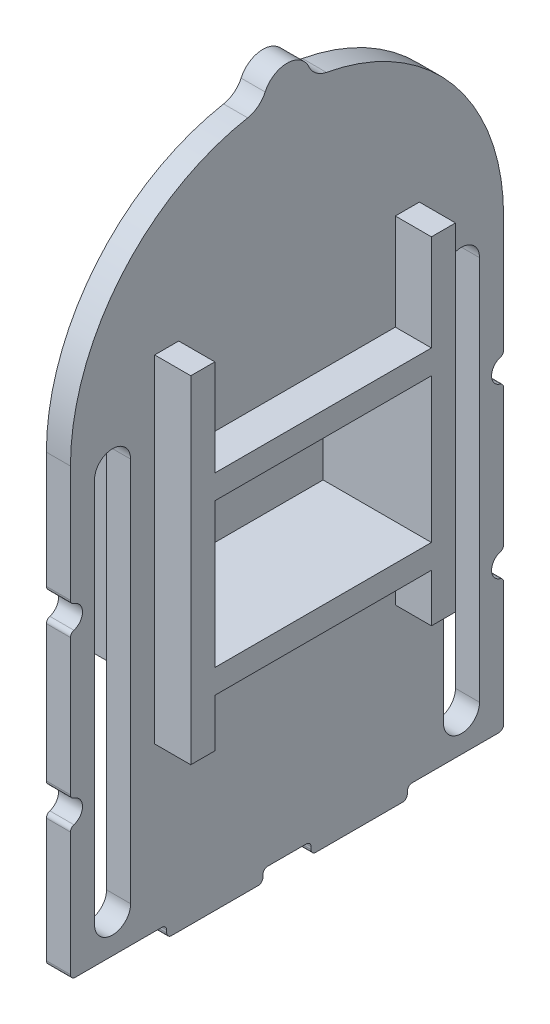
ISO-10303-21;
HEADER;
FILE_DESCRIPTION(('STEP AP214'),'2;1');
FILE_NAME('part.step','',(''),(''),'','','');
FILE_SCHEMA(('AUTOMOTIVE_DESIGN { 1 0 10303 214 1 1 1 1 }'));
ENDSEC;
DATA;
#1=APPLICATION_CONTEXT('core data for automotive mechanical design processes');
#2=APPLICATION_PROTOCOL_DEFINITION('international standard','automotive_design',2000,#1);
#3=PRODUCT_CONTEXT('',#1,'mechanical');
#4=PRODUCT('Part','Part','',(#3));
#5=PRODUCT_RELATED_PRODUCT_CATEGORY('part','',(#4));
#6=PRODUCT_DEFINITION_FORMATION('','',#4);
#7=PRODUCT_DEFINITION_CONTEXT('part definition',#1,'design');
#8=PRODUCT_DEFINITION('design','',#6,#7);
#9=PRODUCT_DEFINITION_SHAPE('','',#8);
#10=(LENGTH_UNIT() NAMED_UNIT(*) SI_UNIT(.MILLI.,.METRE.));
#11=(NAMED_UNIT(*) PLANE_ANGLE_UNIT() SI_UNIT($,.RADIAN.));
#12=(NAMED_UNIT(*) SI_UNIT($,.STERADIAN.) SOLID_ANGLE_UNIT());
#13=UNCERTAINTY_MEASURE_WITH_UNIT(LENGTH_MEASURE(1.E-05),#10,'distance_accuracy_value','');
#14=(GEOMETRIC_REPRESENTATION_CONTEXT(3) GLOBAL_UNCERTAINTY_ASSIGNED_CONTEXT((#13)) GLOBAL_UNIT_ASSIGNED_CONTEXT((#10,
#11,#12)) REPRESENTATION_CONTEXT('',''));
#15=CARTESIAN_POINT('',(0.,0.,0.));
#16=DIRECTION('',(0.,0.,1.));
#17=DIRECTION('',(1.,0.,0.));
#18=AXIS2_PLACEMENT_3D('',#15,#16,#17);
#19=CARTESIAN_POINT('',(1.,-12.5,9.));
#20=DIRECTION('',(1.,0.,0.));
#21=DIRECTION('',(0.,0.,-1.));
#22=AXIS2_PLACEMENT_3D('',#19,#20,#21);
#23=PLANE('',#22);
#24=DIRECTION('',(0.,1.,0.));
#25=VECTOR('',#24,1.);
#26=CARTESIAN_POINT('',(1.,-1.,-8.));
#27=LINE('',#26,#25);
#28=CARTESIAN_POINT('',(1.,-17.,-8.));
#29=VERTEX_POINT('',#28);
#30=CARTESIAN_POINT('',(1.,-1.,-8.));
#31=VERTEX_POINT('',#30);
#32=EDGE_CURVE('E737',#29,#31,#27,.T.);
#33=ORIENTED_EDGE('',*,*,#32,.F.);
#34=CARTESIAN_POINT('',(1.,-17.,-7.25));
#35=DIRECTION('',(1.,0.,0.));
#36=DIRECTION('',(0.,0.,1.));
#37=AXIS2_PLACEMENT_3D('',#34,#35,#36);
#38=CIRCLE('',#37,0.749999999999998);
#39=CARTESIAN_POINT('',(1.,-17.,-6.50000000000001));
#40=VERTEX_POINT('',#39);
#41=EDGE_CURVE('E735',#40,#29,#38,.T.);
#42=ORIENTED_EDGE('',*,*,#41,.F.);
#43=DIRECTION('',(0.,-1.,0.));
#44=VECTOR('',#43,1.);
#45=CARTESIAN_POINT('',(1.,-0.999999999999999,-6.5));
#46=LINE('',#45,#44);
#47=CARTESIAN_POINT('',(1.,-0.999999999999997,-6.5));
#48=VERTEX_POINT('',#47);
#49=EDGE_CURVE('E742',#48,#40,#46,.T.);
#50=ORIENTED_EDGE('',*,*,#49,.F.);
#51=CARTESIAN_POINT('',(1.,-0.999999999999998,-7.25));
#52=DIRECTION('',(1.,0.,0.));
#53=DIRECTION('',(0.,0.,1.));
#54=AXIS2_PLACEMENT_3D('',#51,#52,#53);
#55=CIRCLE('',#54,0.75);
#56=EDGE_CURVE('E739',#31,#48,#55,.T.);
#57=ORIENTED_EDGE('',*,*,#56,.F.);
#58=EDGE_LOOP('',(#33,#42,#50,#57));
#59=FACE_BOUND('',#58,.T.);
#60=CARTESIAN_POINT('',(1.,-12.5,9.));
#61=DIRECTION('',(-1.,0.,0.));
#62=DIRECTION('',(0.,0.,-1.));
#63=AXIS2_PLACEMENT_3D('',#60,#61,#62);
#64=CIRCLE('',#63,0.5);
#65=CARTESIAN_POINT('',(1.,-12.0208425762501,8.85714285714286));
#66=VERTEX_POINT('',#65);
#67=CARTESIAN_POINT('',(1.,-12.97915742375,8.85714285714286));
#68=VERTEX_POINT('',#67);
#69=EDGE_CURVE('E883',#66,#68,#64,.T.);
#70=ORIENTED_EDGE('',*,*,#69,.T.);
#71=CARTESIAN_POINT('',(1.,-13.1708203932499,8.8));
#72=DIRECTION('',(1.,0.,0.));
#73=DIRECTION('',(0.,0.,-1.));
#74=AXIS2_PLACEMENT_3D('',#71,#72,#73);
#75=CIRCLE('',#74,0.2);
#76=CARTESIAN_POINT('',(1.,-13.1708203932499,9.));
#77=VERTEX_POINT('',#76);
#78=EDGE_CURVE('E1025',#68,#77,#75,.T.);
#79=ORIENTED_EDGE('',*,*,#78,.T.);
#80=DIRECTION('',(0.,-1.,0.));
#81=VECTOR('',#80,1.);
#82=CARTESIAN_POINT('',(1.,-13.,9.));
#83=LINE('',#82,#81);
#84=CARTESIAN_POINT('',(1.,-18.3,9.));
#85=VERTEX_POINT('',#84);
#86=EDGE_CURVE('E886',#77,#85,#83,.T.);
#87=ORIENTED_EDGE('',*,*,#86,.T.);
#88=CARTESIAN_POINT('',(1.,-18.3,8.8));
#89=DIRECTION('',(1.,0.,0.));
#90=DIRECTION('',(0.,0.,-1.));
#91=AXIS2_PLACEMENT_3D('',#88,#89,#90);
#92=CIRCLE('',#91,0.2);
#93=CARTESIAN_POINT('',(1.,-18.5,8.8));
#94=VERTEX_POINT('',#93);
#95=EDGE_CURVE('E1017',#85,#94,#92,.T.);
#96=ORIENTED_EDGE('',*,*,#95,.T.);
#97=DIRECTION('',(0.,0.,-1.));
#98=VECTOR('',#97,1.);
#99=CARTESIAN_POINT('',(1.,-18.5,5.));
#100=LINE('',#99,#98);
#101=CARTESIAN_POINT('',(1.,-18.5,5.2));
#102=VERTEX_POINT('',#101);
#103=EDGE_CURVE('E889',#94,#102,#100,.T.);
#104=ORIENTED_EDGE('',*,*,#103,.T.);
#105=CARTESIAN_POINT('',(1.,-18.7,5.2));
#106=DIRECTION('',(1.,0.,0.));
#107=DIRECTION('',(0.,0.,-1.));
#108=AXIS2_PLACEMENT_3D('',#105,#106,#107);
#109=CIRCLE('',#108,0.2);
#110=CARTESIAN_POINT('',(1.,-18.7,5.));
#111=VERTEX_POINT('',#110);
#112=EDGE_CURVE('E1102',#102,#111,#109,.F.);
#113=ORIENTED_EDGE('',*,*,#112,.T.);
#114=DIRECTION('',(0.,-1.,0.));
#115=VECTOR('',#114,1.);
#116=CARTESIAN_POINT('',(1.,-19.,5.));
#117=LINE('',#116,#115);
#118=CARTESIAN_POINT('',(1.,-18.8,5.));
#119=VERTEX_POINT('',#118);
#120=EDGE_CURVE('E892',#111,#119,#117,.T.);
#121=ORIENTED_EDGE('',*,*,#120,.T.);
#122=CARTESIAN_POINT('',(1.,-18.8,4.8));
#123=DIRECTION('',(1.,0.,0.));
#124=DIRECTION('',(0.,0.,-1.));
#125=AXIS2_PLACEMENT_3D('',#122,#123,#124);
#126=CIRCLE('',#125,0.2);
#127=CARTESIAN_POINT('',(1.,-19.,4.8));
#128=VERTEX_POINT('',#127);
#129=EDGE_CURVE('E1013',#119,#128,#126,.T.);
#130=ORIENTED_EDGE('',*,*,#129,.T.);
#131=DIRECTION('',(0.,0.,-1.));
#132=VECTOR('',#131,1.);
#133=CARTESIAN_POINT('',(1.,-19.,5.));
#134=LINE('',#133,#132);
#135=CARTESIAN_POINT('',(1.,-19.,1.2));
#136=VERTEX_POINT('',#135);
#137=EDGE_CURVE('E895',#128,#136,#134,.T.);
#138=ORIENTED_EDGE('',*,*,#137,.T.);
#139=CARTESIAN_POINT('',(1.,-18.8,1.2));
#140=DIRECTION('',(1.,0.,0.));
#141=DIRECTION('',(0.,0.,-1.));
#142=AXIS2_PLACEMENT_3D('',#139,#140,#141);
#143=CIRCLE('',#142,0.2);
#144=CARTESIAN_POINT('',(1.,-18.8,0.999999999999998));
#145=VERTEX_POINT('',#144);
#146=EDGE_CURVE('E1011',#136,#145,#143,.T.);
#147=ORIENTED_EDGE('',*,*,#146,.T.);
#148=DIRECTION('',(0.,1.,0.));
#149=VECTOR('',#148,1.);
#150=CARTESIAN_POINT('',(1.,-18.5,0.999999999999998));
#151=LINE('',#150,#149);
#152=CARTESIAN_POINT('',(1.,-18.7,0.999999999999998));
#153=VERTEX_POINT('',#152);
#154=EDGE_CURVE('E898',#145,#153,#151,.T.);
#155=ORIENTED_EDGE('',*,*,#154,.T.);
#156=CARTESIAN_POINT('',(1.,-18.7,0.799999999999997));
#157=DIRECTION('',(1.,0.,0.));
#158=DIRECTION('',(0.,0.,-1.));
#159=AXIS2_PLACEMENT_3D('',#156,#157,#158);
#160=CIRCLE('',#159,0.2);
#161=CARTESIAN_POINT('',(1.,-18.5,0.799999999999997));
#162=VERTEX_POINT('',#161);
#163=EDGE_CURVE('E1098',#153,#162,#160,.F.);
#164=ORIENTED_EDGE('',*,*,#163,.T.);
#165=DIRECTION('',(0.,0.,-1.));
#166=VECTOR('',#165,1.);
#167=CARTESIAN_POINT('',(1.,-18.5,-1.));
#168=LINE('',#167,#166);
#169=CARTESIAN_POINT('',(1.,-18.5,-0.800000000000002));
#170=VERTEX_POINT('',#169);
#171=EDGE_CURVE('E901',#162,#170,#168,.T.);
#172=ORIENTED_EDGE('',*,*,#171,.T.);
#173=CARTESIAN_POINT('',(1.,-18.7,-0.800000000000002));
#174=DIRECTION('',(1.,0.,0.));
#175=DIRECTION('',(0.,0.,-1.));
#176=AXIS2_PLACEMENT_3D('',#173,#174,#175);
#177=CIRCLE('',#176,0.2);
#178=CARTESIAN_POINT('',(1.,-18.7,-1.));
#179=VERTEX_POINT('',#178);
#180=EDGE_CURVE('E1106',#170,#179,#177,.F.);
#181=ORIENTED_EDGE('',*,*,#180,.T.);
#182=DIRECTION('',(0.,-1.,0.));
#183=VECTOR('',#182,1.);
#184=CARTESIAN_POINT('',(1.,-19.,-1.));
#185=LINE('',#184,#183);
#186=CARTESIAN_POINT('',(1.,-18.8,-1.));
#187=VERTEX_POINT('',#186);
#188=EDGE_CURVE('E904',#179,#187,#185,.T.);
#189=ORIENTED_EDGE('',*,*,#188,.T.);
#190=CARTESIAN_POINT('',(1.,-18.8,-1.2));
#191=DIRECTION('',(1.,0.,0.));
#192=DIRECTION('',(0.,0.,-1.));
#193=AXIS2_PLACEMENT_3D('',#190,#191,#192);
#194=CIRCLE('',#193,0.2);
#195=CARTESIAN_POINT('',(1.,-19.,-1.2));
#196=VERTEX_POINT('',#195);
#197=EDGE_CURVE('E1009',#187,#196,#194,.T.);
#198=ORIENTED_EDGE('',*,*,#197,.T.);
#199=DIRECTION('',(0.,0.,-1.));
#200=VECTOR('',#199,1.);
#201=CARTESIAN_POINT('',(1.,-19.,-1.));
#202=LINE('',#201,#200);
#203=CARTESIAN_POINT('',(1.,-19.,-4.8));
#204=VERTEX_POINT('',#203);
#205=EDGE_CURVE('E907',#196,#204,#202,.T.);
#206=ORIENTED_EDGE('',*,*,#205,.T.);
#207=CARTESIAN_POINT('',(1.,-18.8,-4.8));
#208=DIRECTION('',(1.,0.,0.));
#209=DIRECTION('',(0.,0.,-1.));
#210=AXIS2_PLACEMENT_3D('',#207,#208,#209);
#211=CIRCLE('',#210,0.2);
#212=CARTESIAN_POINT('',(1.,-18.8,-5.));
#213=VERTEX_POINT('',#212);
#214=EDGE_CURVE('E1007',#204,#213,#211,.T.);
#215=ORIENTED_EDGE('',*,*,#214,.T.);
#216=DIRECTION('',(0.,1.,0.));
#217=VECTOR('',#216,1.);
#218=CARTESIAN_POINT('',(1.,-18.5,-5.));
#219=LINE('',#218,#217);
#220=CARTESIAN_POINT('',(1.,-18.7,-5.));
#221=VERTEX_POINT('',#220);
#222=EDGE_CURVE('E910',#213,#221,#219,.T.);
#223=ORIENTED_EDGE('',*,*,#222,.T.);
#224=CARTESIAN_POINT('',(1.,-18.7,-5.2));
#225=DIRECTION('',(1.,0.,0.));
#226=DIRECTION('',(0.,0.,-1.));
#227=AXIS2_PLACEMENT_3D('',#224,#225,#226);
#228=CIRCLE('',#227,0.2);
#229=CARTESIAN_POINT('',(1.,-18.5,-5.2));
#230=VERTEX_POINT('',#229);
#231=EDGE_CURVE('E11',#221,#230,#228,.F.);
#232=ORIENTED_EDGE('',*,*,#231,.T.);
#233=DIRECTION('',(0.,0.,-1.));
#234=VECTOR('',#233,1.);
#235=CARTESIAN_POINT('',(1.,-18.5,-9.));
#236=LINE('',#235,#234);
#237=CARTESIAN_POINT('',(1.,-18.5,-8.8));
#238=VERTEX_POINT('',#237);
#239=EDGE_CURVE('E913',#230,#238,#236,.T.);
#240=ORIENTED_EDGE('',*,*,#239,.T.);
#241=CARTESIAN_POINT('',(1.,-18.3,-8.8));
#242=DIRECTION('',(1.,0.,0.));
#243=DIRECTION('',(0.,0.,-1.));
#244=AXIS2_PLACEMENT_3D('',#241,#242,#243);
#245=CIRCLE('',#244,0.2);
#246=CARTESIAN_POINT('',(1.,-18.3,-9.));
#247=VERTEX_POINT('',#246);
#248=EDGE_CURVE('E1015',#238,#247,#245,.T.);
#249=ORIENTED_EDGE('',*,*,#248,.T.);
#250=DIRECTION('',(0.,1.,0.));
#251=VECTOR('',#250,1.);
#252=CARTESIAN_POINT('',(1.,-13.,-9.00000000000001));
#253=LINE('',#252,#251);
#254=CARTESIAN_POINT('',(1.,-13.1708203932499,-9.00000000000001));
#255=VERTEX_POINT('',#254);
#256=EDGE_CURVE('E850',#247,#255,#253,.T.);
#257=ORIENTED_EDGE('',*,*,#256,.T.);
#258=CARTESIAN_POINT('',(1.,-13.1708203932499,-8.80000000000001));
#259=DIRECTION('',(1.,0.,0.));
#260=DIRECTION('',(0.,0.,-1.));
#261=AXIS2_PLACEMENT_3D('',#258,#259,#260);
#262=CIRCLE('',#261,0.2);
#263=CARTESIAN_POINT('',(1.,-12.97915742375,-8.85714285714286));
#264=VERTEX_POINT('',#263);
#265=EDGE_CURVE('E1005',#255,#264,#262,.T.);
#266=ORIENTED_EDGE('',*,*,#265,.T.);
#267=CARTESIAN_POINT('',(1.,-12.5,-9.00000000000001));
#268=DIRECTION('',(-1.,0.,0.));
#269=DIRECTION('',(0.,0.,-1.));
#270=AXIS2_PLACEMENT_3D('',#267,#268,#269);
#271=CIRCLE('',#270,0.5);
#272=CARTESIAN_POINT('',(1.,-12.02084257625,-8.85714285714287));
#273=VERTEX_POINT('',#272);
#274=EDGE_CURVE('E853',#264,#273,#271,.T.);
#275=ORIENTED_EDGE('',*,*,#274,.T.);
#276=CARTESIAN_POINT('',(1.,-11.8291796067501,-8.80000000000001));
#277=DIRECTION('',(1.,0.,0.));
#278=DIRECTION('',(0.,0.,-1.));
#279=AXIS2_PLACEMENT_3D('',#276,#277,#278);
#280=CIRCLE('',#279,0.2);
#281=CARTESIAN_POINT('',(1.,-11.8291796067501,-9.00000000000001));
#282=VERTEX_POINT('',#281);
#283=EDGE_CURVE('E1003',#273,#282,#280,.T.);
#284=ORIENTED_EDGE('',*,*,#283,.T.);
#285=DIRECTION('',(0.,1.,0.));
#286=VECTOR('',#285,1.);
#287=CARTESIAN_POINT('',(1.,-6.,-9.));
#288=LINE('',#287,#286);
#289=CARTESIAN_POINT('',(1.,-6.17082039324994,-9.));
#290=VERTEX_POINT('',#289);
#291=EDGE_CURVE('E856',#282,#290,#288,.T.);
#292=ORIENTED_EDGE('',*,*,#291,.T.);
#293=CARTESIAN_POINT('',(1.,-6.17082039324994,-8.8));
#294=DIRECTION('',(1.,0.,0.));
#295=DIRECTION('',(0.,0.,-1.));
#296=AXIS2_PLACEMENT_3D('',#293,#294,#295);
#297=CIRCLE('',#296,0.2);
#298=CARTESIAN_POINT('',(1.,-5.97915742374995,-8.85714285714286));
#299=VERTEX_POINT('',#298);
#300=EDGE_CURVE('E1001',#290,#299,#297,.T.);
#301=ORIENTED_EDGE('',*,*,#300,.T.);
#302=CARTESIAN_POINT('',(1.,-5.5,-9.));
#303=DIRECTION('',(-1.,0.,0.));
#304=DIRECTION('',(0.,0.,-1.));
#305=AXIS2_PLACEMENT_3D('',#302,#303,#304);
#306=CIRCLE('',#305,0.5);
#307=CARTESIAN_POINT('',(1.,-5.02084257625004,-8.85714285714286));
#308=VERTEX_POINT('',#307);
#309=EDGE_CURVE('E859',#299,#308,#306,.T.);
#310=ORIENTED_EDGE('',*,*,#309,.T.);
#311=CARTESIAN_POINT('',(1.,-4.82917960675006,-8.8));
#312=DIRECTION('',(1.,0.,0.));
#313=DIRECTION('',(0.,0.,-1.));
#314=AXIS2_PLACEMENT_3D('',#311,#312,#313);
#315=CIRCLE('',#314,0.2);
#316=CARTESIAN_POINT('',(1.,-4.82917960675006,-9.00000000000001));
#317=VERTEX_POINT('',#316);
#318=EDGE_CURVE('E999',#308,#317,#315,.T.);
#319=ORIENTED_EDGE('',*,*,#318,.T.);
#320=DIRECTION('',(0.,1.,0.));
#321=VECTOR('',#320,1.);
#322=CARTESIAN_POINT('',(1.,0.,-9.));
#323=LINE('',#322,#321);
#324=CARTESIAN_POINT('',(1.,0.,-9.));
#325=VERTEX_POINT('',#324);
#326=EDGE_CURVE('E862',#317,#325,#323,.T.);
#327=ORIENTED_EDGE('',*,*,#326,.T.);
#328=CARTESIAN_POINT('',(1.,0.,0.));
#329=DIRECTION('',(1.,0.,0.));
#330=DIRECTION('',(0.,0.,-1.));
#331=AXIS2_PLACEMENT_3D('',#328,#329,#330);
#332=CIRCLE('',#331,9.);
#333=CARTESIAN_POINT('',(1.,8.85,-1.63630681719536));
#334=VERTEX_POINT('',#333);
#335=EDGE_CURVE('E864',#325,#334,#332,.T.);
#336=ORIENTED_EDGE('',*,*,#335,.T.);
#337=CARTESIAN_POINT('',(1.,9.83333333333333,-1.81811868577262));
#338=DIRECTION('',(-1.,0.,0.));
#339=DIRECTION('',(0.,0.,-1.));
#340=AXIS2_PLACEMENT_3D('',#337,#338,#339);
#341=CIRCLE('',#340,1.);
#342=CARTESIAN_POINT('',(1.,9.41666666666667,-0.909059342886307));
#343=VERTEX_POINT('',#342);
#344=EDGE_CURVE('E866',#334,#343,#341,.T.);
#345=ORIENTED_EDGE('',*,*,#344,.T.);
#346=CARTESIAN_POINT('',(1.,9.,0.));
#347=DIRECTION('',(1.,0.,0.));
#348=DIRECTION('',(0.,0.,-1.));
#349=AXIS2_PLACEMENT_3D('',#346,#347,#348);
#350=CIRCLE('',#349,1.);
#351=CARTESIAN_POINT('',(1.,9.41666666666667,0.90905934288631));
#352=VERTEX_POINT('',#351);
#353=EDGE_CURVE('E868',#343,#352,#350,.T.);
#354=ORIENTED_EDGE('',*,*,#353,.T.);
#355=CARTESIAN_POINT('',(1.,9.83333333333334,1.81811868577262));
#356=DIRECTION('',(-1.,0.,0.));
#357=DIRECTION('',(0.,0.,1.));
#358=AXIS2_PLACEMENT_3D('',#355,#356,#357);
#359=CIRCLE('',#358,1.);
#360=CARTESIAN_POINT('',(1.,8.85,1.63630681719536));
#361=VERTEX_POINT('',#360);
#362=EDGE_CURVE('E870',#352,#361,#359,.T.);
#363=ORIENTED_EDGE('',*,*,#362,.T.);
#364=CARTESIAN_POINT('',(1.,0.,0.));
#365=DIRECTION('',(1.,0.,0.));
#366=DIRECTION('',(0.,0.,-1.));
#367=AXIS2_PLACEMENT_3D('',#364,#365,#366);
#368=CIRCLE('',#367,9.);
#369=CARTESIAN_POINT('',(1.,0.,9.));
#370=VERTEX_POINT('',#369);
#371=EDGE_CURVE('E872',#361,#370,#368,.T.);
#372=ORIENTED_EDGE('',*,*,#371,.T.);
#373=DIRECTION('',(0.,-1.,0.));
#374=VECTOR('',#373,1.);
#375=CARTESIAN_POINT('',(1.,0.,9.));
#376=LINE('',#375,#374);
#377=CARTESIAN_POINT('',(1.,-4.82917960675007,9.));
#378=VERTEX_POINT('',#377);
#379=EDGE_CURVE('E874',#370,#378,#376,.T.);
#380=ORIENTED_EDGE('',*,*,#379,.T.);
#381=CARTESIAN_POINT('',(1.,-4.82917960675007,8.8));
#382=DIRECTION('',(1.,0.,0.));
#383=DIRECTION('',(0.,0.,-1.));
#384=AXIS2_PLACEMENT_3D('',#381,#382,#383);
#385=CIRCLE('',#384,0.2);
#386=CARTESIAN_POINT('',(1.,-5.02084257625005,8.85714285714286));
#387=VERTEX_POINT('',#386);
#388=EDGE_CURVE('E1019',#378,#387,#385,.T.);
#389=ORIENTED_EDGE('',*,*,#388,.T.);
#390=CARTESIAN_POINT('',(1.,-5.5,9.));
#391=DIRECTION('',(-1.,0.,0.));
#392=DIRECTION('',(0.,0.,-1.));
#393=AXIS2_PLACEMENT_3D('',#390,#391,#392);
#394=CIRCLE('',#393,0.5);
#395=CARTESIAN_POINT('',(1.,-5.97915742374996,8.85714285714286));
#396=VERTEX_POINT('',#395);
#397=EDGE_CURVE('E877',#387,#396,#394,.T.);
#398=ORIENTED_EDGE('',*,*,#397,.T.);
#399=CARTESIAN_POINT('',(1.,-6.17082039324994,8.8));
#400=DIRECTION('',(1.,0.,0.));
#401=DIRECTION('',(0.,0.,-1.));
#402=AXIS2_PLACEMENT_3D('',#399,#400,#401);
#403=CIRCLE('',#402,0.2);
#404=CARTESIAN_POINT('',(1.,-6.17082039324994,9.));
#405=VERTEX_POINT('',#404);
#406=EDGE_CURVE('E1023',#396,#405,#403,.T.);
#407=ORIENTED_EDGE('',*,*,#406,.T.);
#408=DIRECTION('',(0.,-1.,0.));
#409=VECTOR('',#408,1.);
#410=CARTESIAN_POINT('',(1.,-6.,9.));
#411=LINE('',#410,#409);
#412=CARTESIAN_POINT('',(1.,-11.8291796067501,9.));
#413=VERTEX_POINT('',#412);
#414=EDGE_CURVE('E880',#405,#413,#411,.T.);
#415=ORIENTED_EDGE('',*,*,#414,.T.);
#416=CARTESIAN_POINT('',(1.,-11.8291796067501,8.8));
#417=DIRECTION('',(1.,0.,0.));
#418=DIRECTION('',(0.,0.,-1.));
#419=AXIS2_PLACEMENT_3D('',#416,#417,#418);
#420=CIRCLE('',#419,0.2);
#421=EDGE_CURVE('E1021',#413,#66,#420,.T.);
#422=ORIENTED_EDGE('',*,*,#421,.T.);
#423=EDGE_LOOP('',(#70,#79,#87,#96,#104,#113,#121,#130,#138,#147,#155,#164,#172,#181,#189,#198,
#206,#215,#223,#232,#240,#249,#257,#266,#275,#284,#292,#301,#310,#319,#327,#336,#345,#354,#363,
#372,#380,#389,#398,#407,#415,#422));
#424=FACE_BOUND('',#423,.T.);
#425=DIRECTION('',(0.,-1.,0.));
#426=VECTOR('',#425,1.);
#427=CARTESIAN_POINT('',(1.,-1.,8.));
#428=LINE('',#427,#426);
#429=CARTESIAN_POINT('',(1.,-1.,8.));
#430=VERTEX_POINT('',#429);
#431=CARTESIAN_POINT('',(1.,-17.,8.));
#432=VERTEX_POINT('',#431);
#433=EDGE_CURVE('E768',#430,#432,#428,.T.);
#434=ORIENTED_EDGE('',*,*,#433,.F.);
#435=CARTESIAN_POINT('',(1.,-1.,7.25));
#436=DIRECTION('',(1.,0.,0.));
#437=DIRECTION('',(0.,0.,-1.));
#438=AXIS2_PLACEMENT_3D('',#435,#436,#437);
#439=CIRCLE('',#438,0.75);
#440=CARTESIAN_POINT('',(1.,-1.,6.5));
#441=VERTEX_POINT('',#440);
#442=EDGE_CURVE('E766',#441,#430,#439,.T.);
#443=ORIENTED_EDGE('',*,*,#442,.F.);
#444=DIRECTION('',(0.,1.,0.));
#445=VECTOR('',#444,1.);
#446=CARTESIAN_POINT('',(1.,-1.,6.5));
#447=LINE('',#446,#445);
#448=CARTESIAN_POINT('',(1.,-17.,6.5));
#449=VERTEX_POINT('',#448);
#450=EDGE_CURVE('E773',#449,#441,#447,.T.);
#451=ORIENTED_EDGE('',*,*,#450,.F.);
#452=CARTESIAN_POINT('',(1.,-17.,7.25));
#453=DIRECTION('',(1.,0.,0.));
#454=DIRECTION('',(0.,0.,-1.));
#455=AXIS2_PLACEMENT_3D('',#452,#453,#454);
#456=CIRCLE('',#455,0.749999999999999);
#457=EDGE_CURVE('E770',#432,#449,#456,.T.);
#458=ORIENTED_EDGE('',*,*,#457,.F.);
#459=EDGE_LOOP('',(#434,#443,#451,#458));
#460=FACE_BOUND('',#459,.T.);
#461=DIRECTION('',(0.,1.,0.));
#462=VECTOR('',#461,1.);
#463=CARTESIAN_POINT('',(1.,-1.75,4.5));
#464=LINE('',#463,#462);
#465=CARTESIAN_POINT('',(1.,-1.75,4.5));
#466=VERTEX_POINT('',#465);
#467=CARTESIAN_POINT('',(1.,2.25,4.5));
#468=VERTEX_POINT('',#467);
#469=EDGE_CURVE('E553',#466,#468,#464,.T.);
#470=ORIENTED_EDGE('',*,*,#469,.F.);
#471=DIRECTION('',(0.,0.,1.));
#472=VECTOR('',#471,1.);
#473=CARTESIAN_POINT('',(1.,-1.75,-4.5));
#474=LINE('',#473,#472);
#475=CARTESIAN_POINT('',(1.,-1.75,-4.5));
#476=VERTEX_POINT('',#475);
#477=EDGE_CURVE('E550',#476,#466,#474,.T.);
#478=ORIENTED_EDGE('',*,*,#477,.F.);
#479=DIRECTION('',(0.,-1.,0.));
#480=VECTOR('',#479,1.);
#481=CARTESIAN_POINT('',(1.,2.25,-4.5));
#482=LINE('',#481,#480);
#483=CARTESIAN_POINT('',(1.,2.25,-4.5));
#484=VERTEX_POINT('',#483);
#485=EDGE_CURVE('E573',#484,#476,#482,.T.);
#486=ORIENTED_EDGE('',*,*,#485,.F.);
#487=DIRECTION('',(0.,0.,1.));
#488=VECTOR('',#487,1.);
#489=CARTESIAN_POINT('',(1.,2.25,-5.5));
#490=LINE('',#489,#488);
#491=CARTESIAN_POINT('',(1.,2.25,-5.5));
#492=VERTEX_POINT('',#491);
#493=EDGE_CURVE('E571',#492,#484,#490,.T.);
#494=ORIENTED_EDGE('',*,*,#493,.F.);
#495=DIRECTION('',(0.,1.,0.));
#496=VECTOR('',#495,1.);
#497=CARTESIAN_POINT('',(1.,-11.75,-5.5));
#498=LINE('',#497,#496);
#499=CARTESIAN_POINT('',(1.,-11.75,-5.5));
#500=VERTEX_POINT('',#499);
#501=EDGE_CURVE('E569',#500,#492,#498,.T.);
#502=ORIENTED_EDGE('',*,*,#501,.F.);
#503=DIRECTION('',(0.,0.,-1.));
#504=VECTOR('',#503,1.);
#505=CARTESIAN_POINT('',(1.,-11.75,-4.5));
#506=LINE('',#505,#504);
#507=CARTESIAN_POINT('',(1.,-11.75,-4.5));
#508=VERTEX_POINT('',#507);
#509=EDGE_CURVE('E567',#508,#500,#506,.T.);
#510=ORIENTED_EDGE('',*,*,#509,.F.);
#511=DIRECTION('',(0.,-1.,0.));
#512=VECTOR('',#511,1.);
#513=CARTESIAN_POINT('',(1.,-9.75,-4.5));
#514=LINE('',#513,#512);
#515=CARTESIAN_POINT('',(1.,-9.75,-4.5));
#516=VERTEX_POINT('',#515);
#517=EDGE_CURVE('E565',#516,#508,#514,.T.);
#518=ORIENTED_EDGE('',*,*,#517,.F.);
#519=DIRECTION('',(0.,0.,-1.));
#520=VECTOR('',#519,1.);
#521=CARTESIAN_POINT('',(1.,-9.75,4.5));
#522=LINE('',#521,#520);
#523=CARTESIAN_POINT('',(1.,-9.75,4.5));
#524=VERTEX_POINT('',#523);
#525=EDGE_CURVE('E563',#524,#516,#522,.T.);
#526=ORIENTED_EDGE('',*,*,#525,.F.);
#527=DIRECTION('',(0.,1.,0.));
#528=VECTOR('',#527,1.);
#529=CARTESIAN_POINT('',(1.,-11.75,4.5));
#530=LINE('',#529,#528);
#531=CARTESIAN_POINT('',(1.,-11.75,4.5));
#532=VERTEX_POINT('',#531);
#533=EDGE_CURVE('E561',#532,#524,#530,.T.);
#534=ORIENTED_EDGE('',*,*,#533,.F.);
#535=DIRECTION('',(0.,0.,-1.));
#536=VECTOR('',#535,1.);
#537=CARTESIAN_POINT('',(1.,-11.75,5.5));
#538=LINE('',#537,#536);
#539=CARTESIAN_POINT('',(1.,-11.75,5.5));
#540=VERTEX_POINT('',#539);
#541=EDGE_CURVE('E559',#540,#532,#538,.T.);
#542=ORIENTED_EDGE('',*,*,#541,.F.);
#543=DIRECTION('',(0.,-1.,0.));
#544=VECTOR('',#543,1.);
#545=CARTESIAN_POINT('',(1.,2.25,5.5));
#546=LINE('',#545,#544);
#547=CARTESIAN_POINT('',(1.,2.25,5.5));
#548=VERTEX_POINT('',#547);
#549=EDGE_CURVE('E557',#548,#540,#546,.T.);
#550=ORIENTED_EDGE('',*,*,#549,.F.);
#551=DIRECTION('',(0.,0.,1.));
#552=VECTOR('',#551,1.);
#553=CARTESIAN_POINT('',(1.,2.25,4.5));
#554=LINE('',#553,#552);
#555=EDGE_CURVE('E555',#468,#548,#554,.T.);
#556=ORIENTED_EDGE('',*,*,#555,.F.);
#557=EDGE_LOOP('',(#470,#478,#486,#494,#502,#510,#518,#526,#534,#542,#550,#556));
#558=FACE_BOUND('',#557,.T.);
#559=ADVANCED_FACE('F33',(#59,#424,#460,#558),#23,.T.);
#560=CARTESIAN_POINT('',(0.,-12.5,9.));
#561=DIRECTION('',(1.,0.,0.));
#562=DIRECTION('',(0.,0.,-1.));
#563=AXIS2_PLACEMENT_3D('',#560,#561,#562);
#564=PLANE('',#563);
#565=CARTESIAN_POINT('',(0.,-17.,-7.25));
#566=DIRECTION('',(1.,0.,0.));
#567=DIRECTION('',(0.,0.,1.));
#568=AXIS2_PLACEMENT_3D('',#565,#566,#567);
#569=CIRCLE('',#568,0.749999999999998);
#570=CARTESIAN_POINT('',(0.,-17.,-6.50000000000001));
#571=VERTEX_POINT('',#570);
#572=CARTESIAN_POINT('',(0.,-17.,-8.));
#573=VERTEX_POINT('',#572);
#574=EDGE_CURVE('E723',#571,#573,#569,.T.);
#575=ORIENTED_EDGE('',*,*,#574,.T.);
#576=DIRECTION('',(0.,1.,0.));
#577=VECTOR('',#576,1.);
#578=CARTESIAN_POINT('',(0.,-1.,-8.));
#579=LINE('',#578,#577);
#580=CARTESIAN_POINT('',(0.,-1.,-8.));
#581=VERTEX_POINT('',#580);
#582=EDGE_CURVE('E726',#573,#581,#579,.T.);
#583=ORIENTED_EDGE('',*,*,#582,.T.);
#584=CARTESIAN_POINT('',(0.,-0.999999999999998,-7.25));
#585=DIRECTION('',(1.,0.,0.));
#586=DIRECTION('',(0.,0.,1.));
#587=AXIS2_PLACEMENT_3D('',#584,#585,#586);
#588=CIRCLE('',#587,0.75);
#589=CARTESIAN_POINT('',(0.,-0.999999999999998,-6.5));
#590=VERTEX_POINT('',#589);
#591=EDGE_CURVE('E729',#581,#590,#588,.T.);
#592=ORIENTED_EDGE('',*,*,#591,.T.);
#593=DIRECTION('',(0.,-1.,0.));
#594=VECTOR('',#593,1.);
#595=CARTESIAN_POINT('',(0.,-0.999999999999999,-6.5));
#596=LINE('',#595,#594);
#597=EDGE_CURVE('E732',#590,#571,#596,.T.);
#598=ORIENTED_EDGE('',*,*,#597,.T.);
#599=EDGE_LOOP('',(#575,#583,#592,#598));
#600=FACE_BOUND('',#599,.T.);
#601=DIRECTION('',(0.,-1.,0.));
#602=VECTOR('',#601,1.);
#603=CARTESIAN_POINT('',(0.,-13.,9.));
#604=LINE('',#603,#602);
#605=CARTESIAN_POINT('',(0.,-13.1708203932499,9.));
#606=VERTEX_POINT('',#605);
#607=CARTESIAN_POINT('',(0.,-18.3,9.));
#608=VERTEX_POINT('',#607);
#609=EDGE_CURVE('E821',#606,#608,#604,.T.);
#610=ORIENTED_EDGE('',*,*,#609,.F.);
#611=CARTESIAN_POINT('',(0.,-13.1708203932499,8.8));
#612=DIRECTION('',(1.,0.,0.));
#613=DIRECTION('',(0.,0.,-1.));
#614=AXIS2_PLACEMENT_3D('',#611,#612,#613);
#615=CIRCLE('',#614,0.2);
#616=CARTESIAN_POINT('',(0.,-12.97915742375,8.85714285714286));
#617=VERTEX_POINT('',#616);
#618=EDGE_CURVE('E992',#606,#617,#615,.F.);
#619=ORIENTED_EDGE('',*,*,#618,.T.);
#620=CARTESIAN_POINT('',(0.,-12.5,9.));
#621=DIRECTION('',(-1.,0.,0.));
#622=DIRECTION('',(0.,0.,-1.));
#623=AXIS2_PLACEMENT_3D('',#620,#621,#622);
#624=CIRCLE('',#623,0.5);
#625=CARTESIAN_POINT('',(0.,-12.0208425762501,8.85714285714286));
#626=VERTEX_POINT('',#625);
#627=EDGE_CURVE('E818',#626,#617,#624,.T.);
#628=ORIENTED_EDGE('',*,*,#627,.F.);
#629=CARTESIAN_POINT('',(0.,-11.8291796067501,8.8));
#630=DIRECTION('',(1.,0.,0.));
#631=DIRECTION('',(0.,0.,-1.));
#632=AXIS2_PLACEMENT_3D('',#629,#630,#631);
#633=CIRCLE('',#632,0.2);
#634=CARTESIAN_POINT('',(0.,-11.8291796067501,9.));
#635=VERTEX_POINT('',#634);
#636=EDGE_CURVE('E988',#626,#635,#633,.F.);
#637=ORIENTED_EDGE('',*,*,#636,.T.);
#638=DIRECTION('',(0.,-1.,0.));
#639=VECTOR('',#638,1.);
#640=CARTESIAN_POINT('',(0.,-6.,9.));
#641=LINE('',#640,#639);
#642=CARTESIAN_POINT('',(0.,-6.17082039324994,9.));
#643=VERTEX_POINT('',#642);
#644=EDGE_CURVE('E815',#643,#635,#641,.T.);
#645=ORIENTED_EDGE('',*,*,#644,.F.);
#646=CARTESIAN_POINT('',(0.,-6.17082039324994,8.8));
#647=DIRECTION('',(1.,0.,0.));
#648=DIRECTION('',(0.,0.,-1.));
#649=AXIS2_PLACEMENT_3D('',#646,#647,#648);
#650=CIRCLE('',#649,0.2);
#651=CARTESIAN_POINT('',(0.,-5.97915742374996,8.85714285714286));
#652=VERTEX_POINT('',#651);
#653=EDGE_CURVE('E990',#643,#652,#650,.F.);
#654=ORIENTED_EDGE('',*,*,#653,.T.);
#655=CARTESIAN_POINT('',(0.,-5.5,9.));
#656=DIRECTION('',(-1.,0.,0.));
#657=DIRECTION('',(0.,0.,-1.));
#658=AXIS2_PLACEMENT_3D('',#655,#656,#657);
#659=CIRCLE('',#658,0.5);
#660=CARTESIAN_POINT('',(0.,-5.02084257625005,8.85714285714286));
#661=VERTEX_POINT('',#660);
#662=EDGE_CURVE('E812',#661,#652,#659,.T.);
#663=ORIENTED_EDGE('',*,*,#662,.F.);
#664=CARTESIAN_POINT('',(0.,-4.82917960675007,8.8));
#665=DIRECTION('',(1.,0.,0.));
#666=DIRECTION('',(0.,0.,-1.));
#667=AXIS2_PLACEMENT_3D('',#664,#665,#666);
#668=CIRCLE('',#667,0.2);
#669=CARTESIAN_POINT('',(0.,-4.82917960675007,9.));
#670=VERTEX_POINT('',#669);
#671=EDGE_CURVE('E986',#661,#670,#668,.F.);
#672=ORIENTED_EDGE('',*,*,#671,.T.);
#673=DIRECTION('',(0.,-1.,0.));
#674=VECTOR('',#673,1.);
#675=CARTESIAN_POINT('',(0.,0.,9.));
#676=LINE('',#675,#674);
#677=CARTESIAN_POINT('',(0.,0.,9.));
#678=VERTEX_POINT('',#677);
#679=EDGE_CURVE('E809',#678,#670,#676,.T.);
#680=ORIENTED_EDGE('',*,*,#679,.F.);
#681=CARTESIAN_POINT('',(0.,0.,0.));
#682=DIRECTION('',(1.,0.,0.));
#683=DIRECTION('',(0.,0.,-1.));
#684=AXIS2_PLACEMENT_3D('',#681,#682,#683);
#685=CIRCLE('',#684,9.);
#686=CARTESIAN_POINT('',(0.,8.85,1.63630681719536));
#687=VERTEX_POINT('',#686);
#688=EDGE_CURVE('E807',#687,#678,#685,.T.);
#689=ORIENTED_EDGE('',*,*,#688,.F.);
#690=CARTESIAN_POINT('',(0.,9.83333333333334,1.81811868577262));
#691=DIRECTION('',(-1.,0.,0.));
#692=DIRECTION('',(0.,0.,1.));
#693=AXIS2_PLACEMENT_3D('',#690,#691,#692);
#694=CIRCLE('',#693,1.);
#695=CARTESIAN_POINT('',(0.,9.41666666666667,0.90905934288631));
#696=VERTEX_POINT('',#695);
#697=EDGE_CURVE('E805',#696,#687,#694,.T.);
#698=ORIENTED_EDGE('',*,*,#697,.F.);
#699=CARTESIAN_POINT('',(0.,9.,0.));
#700=DIRECTION('',(1.,0.,0.));
#701=DIRECTION('',(0.,0.,-1.));
#702=AXIS2_PLACEMENT_3D('',#699,#700,#701);
#703=CIRCLE('',#702,1.);
#704=CARTESIAN_POINT('',(0.,9.41666666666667,-0.909059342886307));
#705=VERTEX_POINT('',#704);
#706=EDGE_CURVE('E803',#705,#696,#703,.T.);
#707=ORIENTED_EDGE('',*,*,#706,.F.);
#708=CARTESIAN_POINT('',(0.,9.83333333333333,-1.81811868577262));
#709=DIRECTION('',(-1.,0.,0.));
#710=DIRECTION('',(0.,0.,-1.));
#711=AXIS2_PLACEMENT_3D('',#708,#709,#710);
#712=CIRCLE('',#711,1.);
#713=CARTESIAN_POINT('',(0.,8.85,-1.63630681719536));
#714=VERTEX_POINT('',#713);
#715=EDGE_CURVE('E801',#714,#705,#712,.T.);
#716=ORIENTED_EDGE('',*,*,#715,.F.);
#717=CARTESIAN_POINT('',(0.,0.,0.));
#718=DIRECTION('',(1.,0.,0.));
#719=DIRECTION('',(0.,0.,-1.));
#720=AXIS2_PLACEMENT_3D('',#717,#718,#719);
#721=CIRCLE('',#720,9.);
#722=CARTESIAN_POINT('',(0.,0.,-9.));
#723=VERTEX_POINT('',#722);
#724=EDGE_CURVE('E799',#723,#714,#721,.T.);
#725=ORIENTED_EDGE('',*,*,#724,.F.);
#726=DIRECTION('',(0.,1.,0.));
#727=VECTOR('',#726,1.);
#728=CARTESIAN_POINT('',(0.,0.,-9.));
#729=LINE('',#728,#727);
#730=CARTESIAN_POINT('',(0.,-4.82917960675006,-9.00000000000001));
#731=VERTEX_POINT('',#730);
#732=EDGE_CURVE('E797',#731,#723,#729,.T.);
#733=ORIENTED_EDGE('',*,*,#732,.F.);
#734=CARTESIAN_POINT('',(0.,-4.82917960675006,-8.8));
#735=DIRECTION('',(1.,0.,0.));
#736=DIRECTION('',(0.,0.,-1.));
#737=AXIS2_PLACEMENT_3D('',#734,#735,#736);
#738=CIRCLE('',#737,0.2);
#739=CARTESIAN_POINT('',(0.,-5.02084257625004,-8.85714285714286));
#740=VERTEX_POINT('',#739);
#741=EDGE_CURVE('E966',#731,#740,#738,.F.);
#742=ORIENTED_EDGE('',*,*,#741,.T.);
#743=CARTESIAN_POINT('',(0.,-5.5,-9.));
#744=DIRECTION('',(-1.,0.,0.));
#745=DIRECTION('',(0.,0.,-1.));
#746=AXIS2_PLACEMENT_3D('',#743,#744,#745);
#747=CIRCLE('',#746,0.5);
#748=CARTESIAN_POINT('',(0.,-5.97915742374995,-8.85714285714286));
#749=VERTEX_POINT('',#748);
#750=EDGE_CURVE('E794',#749,#740,#747,.T.);
#751=ORIENTED_EDGE('',*,*,#750,.F.);
#752=CARTESIAN_POINT('',(0.,-6.17082039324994,-8.8));
#753=DIRECTION('',(1.,0.,0.));
#754=DIRECTION('',(0.,0.,-1.));
#755=AXIS2_PLACEMENT_3D('',#752,#753,#754);
#756=CIRCLE('',#755,0.2);
#757=CARTESIAN_POINT('',(0.,-6.17082039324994,-9.));
#758=VERTEX_POINT('',#757);
#759=EDGE_CURVE('E968',#749,#758,#756,.F.);
#760=ORIENTED_EDGE('',*,*,#759,.T.);
#761=DIRECTION('',(0.,1.,0.));
#762=VECTOR('',#761,1.);
#763=CARTESIAN_POINT('',(0.,-6.,-9.));
#764=LINE('',#763,#762);
#765=CARTESIAN_POINT('',(0.,-11.8291796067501,-9.00000000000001));
#766=VERTEX_POINT('',#765);
#767=EDGE_CURVE('E791',#766,#758,#764,.T.);
#768=ORIENTED_EDGE('',*,*,#767,.F.);
#769=CARTESIAN_POINT('',(0.,-11.8291796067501,-8.80000000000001));
#770=DIRECTION('',(1.,0.,0.));
#771=DIRECTION('',(0.,0.,-1.));
#772=AXIS2_PLACEMENT_3D('',#769,#770,#771);
#773=CIRCLE('',#772,0.2);
#774=CARTESIAN_POINT('',(0.,-12.02084257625,-8.85714285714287));
#775=VERTEX_POINT('',#774);
#776=EDGE_CURVE('E970',#766,#775,#773,.F.);
#777=ORIENTED_EDGE('',*,*,#776,.T.);
#778=CARTESIAN_POINT('',(0.,-12.5,-9.00000000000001));
#779=DIRECTION('',(-1.,0.,0.));
#780=DIRECTION('',(0.,0.,-1.));
#781=AXIS2_PLACEMENT_3D('',#778,#779,#780);
#782=CIRCLE('',#781,0.5);
#783=CARTESIAN_POINT('',(0.,-12.97915742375,-8.85714285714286));
#784=VERTEX_POINT('',#783);
#785=EDGE_CURVE('E788',#784,#775,#782,.T.);
#786=ORIENTED_EDGE('',*,*,#785,.F.);
#787=CARTESIAN_POINT('',(0.,-13.1708203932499,-8.80000000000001));
#788=DIRECTION('',(1.,0.,0.));
#789=DIRECTION('',(0.,0.,-1.));
#790=AXIS2_PLACEMENT_3D('',#787,#788,#789);
#791=CIRCLE('',#790,0.2);
#792=CARTESIAN_POINT('',(0.,-13.1708203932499,-9.00000000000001));
#793=VERTEX_POINT('',#792);
#794=EDGE_CURVE('E972',#784,#793,#791,.F.);
#795=ORIENTED_EDGE('',*,*,#794,.T.);
#796=DIRECTION('',(0.,1.,0.));
#797=VECTOR('',#796,1.);
#798=CARTESIAN_POINT('',(0.,-13.,-9.00000000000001));
#799=LINE('',#798,#797);
#800=CARTESIAN_POINT('',(0.,-18.3,-9.));
#801=VERTEX_POINT('',#800);
#802=EDGE_CURVE('E785',#801,#793,#799,.T.);
#803=ORIENTED_EDGE('',*,*,#802,.F.);
#804=CARTESIAN_POINT('',(0.,-18.3,-8.8));
#805=DIRECTION('',(1.,0.,0.));
#806=DIRECTION('',(0.,0.,-1.));
#807=AXIS2_PLACEMENT_3D('',#804,#805,#806);
#808=CIRCLE('',#807,0.2);
#809=CARTESIAN_POINT('',(0.,-18.5,-8.8));
#810=VERTEX_POINT('',#809);
#811=EDGE_CURVE('E982',#801,#810,#808,.F.);
#812=ORIENTED_EDGE('',*,*,#811,.T.);
#813=DIRECTION('',(0.,0.,-1.));
#814=VECTOR('',#813,1.);
#815=CARTESIAN_POINT('',(0.,-18.5,-9.));
#816=LINE('',#815,#814);
#817=CARTESIAN_POINT('',(0.,-18.5,-5.2));
#818=VERTEX_POINT('',#817);
#819=EDGE_CURVE('E848',#818,#810,#816,.T.);
#820=ORIENTED_EDGE('',*,*,#819,.F.);
#821=CARTESIAN_POINT('',(0.,-18.7,-5.2));
#822=DIRECTION('',(1.,0.,0.));
#823=DIRECTION('',(0.,0.,-1.));
#824=AXIS2_PLACEMENT_3D('',#821,#822,#823);
#825=CIRCLE('',#824,0.2);
#826=CARTESIAN_POINT('',(0.,-18.7,-5.));
#827=VERTEX_POINT('',#826);
#828=EDGE_CURVE('E41',#818,#827,#825,.T.);
#829=ORIENTED_EDGE('',*,*,#828,.T.);
#830=DIRECTION('',(0.,1.,0.));
#831=VECTOR('',#830,1.);
#832=CARTESIAN_POINT('',(0.,-18.5,-5.));
#833=LINE('',#832,#831);
#834=CARTESIAN_POINT('',(0.,-18.8,-5.));
#835=VERTEX_POINT('',#834);
#836=EDGE_CURVE('E845',#835,#827,#833,.T.);
#837=ORIENTED_EDGE('',*,*,#836,.F.);
#838=CARTESIAN_POINT('',(0.,-18.8,-4.8));
#839=DIRECTION('',(1.,0.,0.));
#840=DIRECTION('',(0.,0.,-1.));
#841=AXIS2_PLACEMENT_3D('',#838,#839,#840);
#842=CIRCLE('',#841,0.2);
#843=CARTESIAN_POINT('',(0.,-19.,-4.8));
#844=VERTEX_POINT('',#843);
#845=EDGE_CURVE('E974',#835,#844,#842,.F.);
#846=ORIENTED_EDGE('',*,*,#845,.T.);
#847=DIRECTION('',(0.,0.,-1.));
#848=VECTOR('',#847,1.);
#849=CARTESIAN_POINT('',(0.,-19.,-1.));
#850=LINE('',#849,#848);
#851=CARTESIAN_POINT('',(0.,-19.,-1.2));
#852=VERTEX_POINT('',#851);
#853=EDGE_CURVE('E842',#852,#844,#850,.T.);
#854=ORIENTED_EDGE('',*,*,#853,.F.);
#855=CARTESIAN_POINT('',(0.,-18.8,-1.2));
#856=DIRECTION('',(1.,0.,0.));
#857=DIRECTION('',(0.,0.,-1.));
#858=AXIS2_PLACEMENT_3D('',#855,#856,#857);
#859=CIRCLE('',#858,0.2);
#860=CARTESIAN_POINT('',(0.,-18.8,-1.));
#861=VERTEX_POINT('',#860);
#862=EDGE_CURVE('E976',#852,#861,#859,.F.);
#863=ORIENTED_EDGE('',*,*,#862,.T.);
#864=DIRECTION('',(0.,-1.,0.));
#865=VECTOR('',#864,1.);
#866=CARTESIAN_POINT('',(0.,-19.,-1.));
#867=LINE('',#866,#865);
#868=CARTESIAN_POINT('',(0.,-18.7,-1.));
#869=VERTEX_POINT('',#868);
#870=EDGE_CURVE('E839',#869,#861,#867,.T.);
#871=ORIENTED_EDGE('',*,*,#870,.F.);
#872=CARTESIAN_POINT('',(0.,-18.7,-0.800000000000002));
#873=DIRECTION('',(1.,0.,0.));
#874=DIRECTION('',(0.,0.,-1.));
#875=AXIS2_PLACEMENT_3D('',#872,#873,#874);
#876=CIRCLE('',#875,0.2);
#877=CARTESIAN_POINT('',(0.,-18.5,-0.800000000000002));
#878=VERTEX_POINT('',#877);
#879=EDGE_CURVE('E1104',#869,#878,#876,.T.);
#880=ORIENTED_EDGE('',*,*,#879,.T.);
#881=DIRECTION('',(0.,0.,-1.));
#882=VECTOR('',#881,1.);
#883=CARTESIAN_POINT('',(0.,-18.5,-1.));
#884=LINE('',#883,#882);
#885=CARTESIAN_POINT('',(0.,-18.5,0.799999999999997));
#886=VERTEX_POINT('',#885);
#887=EDGE_CURVE('E836',#886,#878,#884,.T.);
#888=ORIENTED_EDGE('',*,*,#887,.F.);
#889=CARTESIAN_POINT('',(0.,-18.7,0.799999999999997));
#890=DIRECTION('',(1.,0.,0.));
#891=DIRECTION('',(0.,0.,-1.));
#892=AXIS2_PLACEMENT_3D('',#889,#890,#891);
#893=CIRCLE('',#892,0.2);
#894=CARTESIAN_POINT('',(0.,-18.7,0.999999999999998));
#895=VERTEX_POINT('',#894);
#896=EDGE_CURVE('E1096',#886,#895,#893,.T.);
#897=ORIENTED_EDGE('',*,*,#896,.T.);
#898=DIRECTION('',(0.,1.,0.));
#899=VECTOR('',#898,1.);
#900=CARTESIAN_POINT('',(0.,-18.5,0.999999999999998));
#901=LINE('',#900,#899);
#902=CARTESIAN_POINT('',(0.,-18.8,0.999999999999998));
#903=VERTEX_POINT('',#902);
#904=EDGE_CURVE('E833',#903,#895,#901,.T.);
#905=ORIENTED_EDGE('',*,*,#904,.F.);
#906=CARTESIAN_POINT('',(0.,-18.8,1.2));
#907=DIRECTION('',(1.,0.,0.));
#908=DIRECTION('',(0.,0.,-1.));
#909=AXIS2_PLACEMENT_3D('',#906,#907,#908);
#910=CIRCLE('',#909,0.2);
#911=CARTESIAN_POINT('',(0.,-19.,1.2));
#912=VERTEX_POINT('',#911);
#913=EDGE_CURVE('E978',#903,#912,#910,.F.);
#914=ORIENTED_EDGE('',*,*,#913,.T.);
#915=DIRECTION('',(0.,0.,-1.));
#916=VECTOR('',#915,1.);
#917=CARTESIAN_POINT('',(0.,-19.,5.));
#918=LINE('',#917,#916);
#919=CARTESIAN_POINT('',(0.,-19.,4.8));
#920=VERTEX_POINT('',#919);
#921=EDGE_CURVE('E830',#920,#912,#918,.T.);
#922=ORIENTED_EDGE('',*,*,#921,.F.);
#923=CARTESIAN_POINT('',(0.,-18.8,4.8));
#924=DIRECTION('',(1.,0.,0.));
#925=DIRECTION('',(0.,0.,-1.));
#926=AXIS2_PLACEMENT_3D('',#923,#924,#925);
#927=CIRCLE('',#926,0.2);
#928=CARTESIAN_POINT('',(0.,-18.8,5.));
#929=VERTEX_POINT('',#928);
#930=EDGE_CURVE('E980',#920,#929,#927,.F.);
#931=ORIENTED_EDGE('',*,*,#930,.T.);
#932=DIRECTION('',(0.,-1.,0.));
#933=VECTOR('',#932,1.);
#934=CARTESIAN_POINT('',(0.,-19.,5.));
#935=LINE('',#934,#933);
#936=CARTESIAN_POINT('',(0.,-18.7,5.));
#937=VERTEX_POINT('',#936);
#938=EDGE_CURVE('E827',#937,#929,#935,.T.);
#939=ORIENTED_EDGE('',*,*,#938,.F.);
#940=CARTESIAN_POINT('',(0.,-18.7,5.2));
#941=DIRECTION('',(1.,0.,0.));
#942=DIRECTION('',(0.,0.,-1.));
#943=AXIS2_PLACEMENT_3D('',#940,#941,#942);
#944=CIRCLE('',#943,0.2);
#945=CARTESIAN_POINT('',(0.,-18.5,5.2));
#946=VERTEX_POINT('',#945);
#947=EDGE_CURVE('E1100',#937,#946,#944,.T.);
#948=ORIENTED_EDGE('',*,*,#947,.T.);
#949=DIRECTION('',(0.,0.,-1.));
#950=VECTOR('',#949,1.);
#951=CARTESIAN_POINT('',(0.,-18.5,5.));
#952=LINE('',#951,#950);
#953=CARTESIAN_POINT('',(0.,-18.5,8.8));
#954=VERTEX_POINT('',#953);
#955=EDGE_CURVE('E824',#954,#946,#952,.T.);
#956=ORIENTED_EDGE('',*,*,#955,.F.);
#957=CARTESIAN_POINT('',(0.,-18.3,8.8));
#958=DIRECTION('',(1.,0.,0.));
#959=DIRECTION('',(0.,0.,-1.));
#960=AXIS2_PLACEMENT_3D('',#957,#958,#959);
#961=CIRCLE('',#960,0.2);
#962=EDGE_CURVE('E984',#954,#608,#961,.F.);
#963=ORIENTED_EDGE('',*,*,#962,.T.);
#964=EDGE_LOOP('',(#610,#619,#628,#637,#645,#654,#663,#672,#680,#689,#698,#707,#716,#725,#733,
#742,#751,#760,#768,#777,#786,#795,#803,#812,#820,#829,#837,#846,#854,#863,#871,#880,#888,#897,
#905,#914,#922,#931,#939,#948,#956,#963));
#965=FACE_BOUND('',#964,.T.);
#966=CARTESIAN_POINT('',(0.,-1.,7.25));
#967=DIRECTION('',(1.,0.,0.));
#968=DIRECTION('',(0.,0.,-1.));
#969=AXIS2_PLACEMENT_3D('',#966,#967,#968);
#970=CIRCLE('',#969,0.75);
#971=CARTESIAN_POINT('',(0.,-0.999999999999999,6.5));
#972=VERTEX_POINT('',#971);
#973=CARTESIAN_POINT('',(0.,-1.,8.));
#974=VERTEX_POINT('',#973);
#975=EDGE_CURVE('E754',#972,#974,#970,.T.);
#976=ORIENTED_EDGE('',*,*,#975,.T.);
#977=DIRECTION('',(0.,-1.,0.));
#978=VECTOR('',#977,1.);
#979=CARTESIAN_POINT('',(0.,-1.,8.));
#980=LINE('',#979,#978);
#981=CARTESIAN_POINT('',(0.,-17.,8.));
#982=VERTEX_POINT('',#981);
#983=EDGE_CURVE('E757',#974,#982,#980,.T.);
#984=ORIENTED_EDGE('',*,*,#983,.T.);
#985=CARTESIAN_POINT('',(0.,-17.,7.25));
#986=DIRECTION('',(1.,0.,0.));
#987=DIRECTION('',(0.,0.,-1.));
#988=AXIS2_PLACEMENT_3D('',#985,#986,#987);
#989=CIRCLE('',#988,0.749999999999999);
#990=CARTESIAN_POINT('',(0.,-17.,6.5));
#991=VERTEX_POINT('',#990);
#992=EDGE_CURVE('E760',#982,#991,#989,.T.);
#993=ORIENTED_EDGE('',*,*,#992,.T.);
#994=DIRECTION('',(0.,1.,0.));
#995=VECTOR('',#994,1.);
#996=CARTESIAN_POINT('',(0.,-1.,6.5));
#997=LINE('',#996,#995);
#998=EDGE_CURVE('E763',#991,#972,#997,.T.);
#999=ORIENTED_EDGE('',*,*,#998,.T.);
#1000=EDGE_LOOP('',(#976,#984,#993,#999));
#1001=FACE_BOUND('',#1000,.T.);
#1002=DIRECTION('',(0.,-1.,0.));
#1003=VECTOR('',#1002,1.);
#1004=CARTESIAN_POINT('',(0.,-9.75,-5.5));
#1005=LINE('',#1004,#1003);
#1006=CARTESIAN_POINT('',(0.,-1.75,-5.5));
#1007=VERTEX_POINT('',#1006);
#1008=CARTESIAN_POINT('',(0.,-9.75,-5.5));
#1009=VERTEX_POINT('',#1008);
#1010=EDGE_CURVE('E703',#1007,#1009,#1005,.T.);
#1011=ORIENTED_EDGE('',*,*,#1010,.F.);
#1012=DIRECTION('',(0.,0.,-1.));
#1013=VECTOR('',#1012,1.);
#1014=CARTESIAN_POINT('',(0.,-1.75,-5.5));
#1015=LINE('',#1014,#1013);
#1016=CARTESIAN_POINT('',(0.,-1.75,5.5));
#1017=VERTEX_POINT('',#1016);
#1018=EDGE_CURVE('E712',#1017,#1007,#1015,.T.);
#1019=ORIENTED_EDGE('',*,*,#1018,.F.);
#1020=DIRECTION('',(0.,1.,0.));
#1021=VECTOR('',#1020,1.);
#1022=CARTESIAN_POINT('',(0.,-9.75,5.5));
#1023=LINE('',#1022,#1021);
#1024=CARTESIAN_POINT('',(0.,-9.75,5.5));
#1025=VERTEX_POINT('',#1024);
#1026=EDGE_CURVE('E709',#1025,#1017,#1023,.T.);
#1027=ORIENTED_EDGE('',*,*,#1026,.F.);
#1028=DIRECTION('',(0.,0.,1.));
#1029=VECTOR('',#1028,1.);
#1030=CARTESIAN_POINT('',(0.,-9.75,-5.5));
#1031=LINE('',#1030,#1029);
#1032=EDGE_CURVE('E706',#1009,#1025,#1031,.T.);
#1033=ORIENTED_EDGE('',*,*,#1032,.F.);
#1034=EDGE_LOOP('',(#1011,#1019,#1027,#1033));
#1035=FACE_BOUND('',#1034,.T.);
#1036=ADVANCED_FACE('F1111',(#600,#965,#1001,#1035),#564,.F.);
#1037=CARTESIAN_POINT('',(1.,-13.,-9.00000000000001));
#1038=DIRECTION('',(0.,0.,1.));
#1039=DIRECTION('',(0.,-1.,0.));
#1040=AXIS2_PLACEMENT_3D('',#1037,#1038,#1039);
#1041=PLANE('',#1040);
#1042=ORIENTED_EDGE('',*,*,#256,.F.);
#1043=DIRECTION('',(-1.,0.,0.));
#1044=VECTOR('',#1043,1.);
#1045=CARTESIAN_POINT('',(1.,-18.3,-9.));
#1046=LINE('',#1045,#1044);
#1047=EDGE_CURVE('E1056',#247,#801,#1046,.T.);
#1048=ORIENTED_EDGE('',*,*,#1047,.T.);
#1049=ORIENTED_EDGE('',*,*,#802,.T.);
#1050=DIRECTION('',(-1.,0.,0.));
#1051=VECTOR('',#1050,1.);
#1052=CARTESIAN_POINT('',(1.,-13.1708203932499,-9.00000000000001));
#1053=LINE('',#1052,#1051);
#1054=EDGE_CURVE('E1054',#793,#255,#1053,.F.);
#1055=ORIENTED_EDGE('',*,*,#1054,.T.);
#1056=EDGE_LOOP('',(#1042,#1048,#1049,#1055));
#1057=FACE_BOUND('',#1056,.T.);
#1058=ADVANCED_FACE('F35',(#1057),#1041,.F.);
#1059=CARTESIAN_POINT('',(1.,-12.5,-9.00000000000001));
#1060=DIRECTION('',(-1.,0.,0.));
#1061=DIRECTION('',(0.,0.,1.));
#1062=AXIS2_PLACEMENT_3D('',#1059,#1060,#1061);
#1063=CYLINDRICAL_SURFACE('',#1062,0.5);
#1064=ORIENTED_EDGE('',*,*,#274,.F.);
#1065=DIRECTION('',(-1.,0.,0.));
#1066=VECTOR('',#1065,1.);
#1067=CARTESIAN_POINT('',(1.,-12.97915742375,-8.85714285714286));
#1068=LINE('',#1067,#1066);
#1069=EDGE_CURVE('E1080',#264,#784,#1068,.T.);
#1070=ORIENTED_EDGE('',*,*,#1069,.T.);
#1071=ORIENTED_EDGE('',*,*,#785,.T.);
#1072=DIRECTION('',(-1.,0.,0.));
#1073=VECTOR('',#1072,1.);
#1074=CARTESIAN_POINT('',(1.,-12.02084257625,-8.85714285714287));
#1075=LINE('',#1074,#1073);
#1076=EDGE_CURVE('E1078',#775,#273,#1075,.F.);
#1077=ORIENTED_EDGE('',*,*,#1076,.T.);
#1078=EDGE_LOOP('',(#1064,#1070,#1071,#1077));
#1079=FACE_BOUND('',#1078,.T.);
#1080=ADVANCED_FACE('F1140',(#1079),#1063,.F.);
#1081=CARTESIAN_POINT('',(1.,-6.,-9.));
#1082=DIRECTION('',(0.,0.,1.));
#1083=DIRECTION('',(0.,-1.,0.));
#1084=AXIS2_PLACEMENT_3D('',#1081,#1082,#1083);
#1085=PLANE('',#1084);
#1086=ORIENTED_EDGE('',*,*,#291,.F.);
#1087=DIRECTION('',(-1.,0.,0.));
#1088=VECTOR('',#1087,1.);
#1089=CARTESIAN_POINT('',(1.,-11.8291796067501,-9.00000000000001));
#1090=LINE('',#1089,#1088);
#1091=EDGE_CURVE('E1085',#282,#766,#1090,.T.);
#1092=ORIENTED_EDGE('',*,*,#1091,.T.);
#1093=ORIENTED_EDGE('',*,*,#767,.T.);
#1094=DIRECTION('',(-1.,0.,0.));
#1095=VECTOR('',#1094,1.);
#1096=CARTESIAN_POINT('',(1.,-6.17082039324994,-9.));
#1097=LINE('',#1096,#1095);
#1098=EDGE_CURVE('E1083',#758,#290,#1097,.F.);
#1099=ORIENTED_EDGE('',*,*,#1098,.T.);
#1100=EDGE_LOOP('',(#1086,#1092,#1093,#1099));
#1101=FACE_BOUND('',#1100,.T.);
#1102=ADVANCED_FACE('F1149',(#1101),#1085,.F.);
#1103=CARTESIAN_POINT('',(1.,-5.5,-9.));
#1104=DIRECTION('',(-1.,0.,0.));
#1105=DIRECTION('',(0.,0.,1.));
#1106=AXIS2_PLACEMENT_3D('',#1103,#1104,#1105);
#1107=CYLINDRICAL_SURFACE('',#1106,0.5);
#1108=ORIENTED_EDGE('',*,*,#309,.F.);
#1109=DIRECTION('',(-1.,0.,0.));
#1110=VECTOR('',#1109,1.);
#1111=CARTESIAN_POINT('',(1.,-5.97915742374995,-8.85714285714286));
#1112=LINE('',#1111,#1110);
#1113=EDGE_CURVE('E1090',#299,#749,#1112,.T.);
#1114=ORIENTED_EDGE('',*,*,#1113,.T.);
#1115=ORIENTED_EDGE('',*,*,#750,.T.);
#1116=DIRECTION('',(-1.,0.,0.));
#1117=VECTOR('',#1116,1.);
#1118=CARTESIAN_POINT('',(1.,-5.02084257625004,-8.85714285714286));
#1119=LINE('',#1118,#1117);
#1120=EDGE_CURVE('E1088',#740,#308,#1119,.F.);
#1121=ORIENTED_EDGE('',*,*,#1120,.T.);
#1122=EDGE_LOOP('',(#1108,#1114,#1115,#1121));
#1123=FACE_BOUND('',#1122,.T.);
#1124=ADVANCED_FACE('F1158',(#1123),#1107,.F.);
#1125=CARTESIAN_POINT('',(1.,0.,-9.));
#1126=DIRECTION('',(0.,0.,1.));
#1127=DIRECTION('',(0.,-1.,0.));
#1128=AXIS2_PLACEMENT_3D('',#1125,#1126,#1127);
#1129=PLANE('',#1128);
#1130=ORIENTED_EDGE('',*,*,#326,.F.);
#1131=DIRECTION('',(-1.,0.,0.));
#1132=VECTOR('',#1131,1.);
#1133=CARTESIAN_POINT('',(1.,-4.82917960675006,-9.00000000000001));
#1134=LINE('',#1133,#1132);
#1135=EDGE_CURVE('E1093',#317,#731,#1134,.T.);
#1136=ORIENTED_EDGE('',*,*,#1135,.T.);
#1137=ORIENTED_EDGE('',*,*,#732,.T.);
#1138=DIRECTION('',(-1.,0.,0.));
#1139=VECTOR('',#1138,1.);
#1140=CARTESIAN_POINT('',(1.,0.,-9.));
#1141=LINE('',#1140,#1139);
#1142=EDGE_CURVE('E930',#325,#723,#1141,.T.);
#1143=ORIENTED_EDGE('',*,*,#1142,.F.);
#1144=EDGE_LOOP('',(#1130,#1136,#1137,#1143));
#1145=FACE_BOUND('',#1144,.T.);
#1146=ADVANCED_FACE('F1167',(#1145),#1129,.F.);
#1147=CARTESIAN_POINT('',(1.,0.,0.));
#1148=DIRECTION('',(-1.,0.,0.));
#1149=DIRECTION('',(0.,0.,1.));
#1150=AXIS2_PLACEMENT_3D('',#1147,#1148,#1149);
#1151=CYLINDRICAL_SURFACE('',#1150,9.);
#1152=ORIENTED_EDGE('',*,*,#724,.T.);
#1153=DIRECTION('',(-1.,0.,0.));
#1154=VECTOR('',#1153,1.);
#1155=CARTESIAN_POINT('',(1.,8.85,-1.63630681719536));
#1156=LINE('',#1155,#1154);
#1157=EDGE_CURVE('E927',#334,#714,#1156,.T.);
#1158=ORIENTED_EDGE('',*,*,#1157,.F.);
#1159=ORIENTED_EDGE('',*,*,#335,.F.);
#1160=ORIENTED_EDGE('',*,*,#1142,.T.);
#1161=EDGE_LOOP('',(#1152,#1158,#1159,#1160));
#1162=FACE_BOUND('',#1161,.T.);
#1163=ADVANCED_FACE('F1173',(#1162),#1151,.T.);
#1164=CARTESIAN_POINT('',(1.,9.83333333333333,-1.81811868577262));
#1165=DIRECTION('',(-1.,0.,0.));
#1166=DIRECTION('',(0.,0.,1.));
#1167=AXIS2_PLACEMENT_3D('',#1164,#1165,#1166);
#1168=CYLINDRICAL_SURFACE('',#1167,1.);
#1169=ORIENTED_EDGE('',*,*,#715,.T.);
#1170=DIRECTION('',(-1.,0.,0.));
#1171=VECTOR('',#1170,1.);
#1172=CARTESIAN_POINT('',(1.,9.41666666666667,-0.909059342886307));
#1173=LINE('',#1172,#1171);
#1174=EDGE_CURVE('E924',#343,#705,#1173,.T.);
#1175=ORIENTED_EDGE('',*,*,#1174,.F.);
#1176=ORIENTED_EDGE('',*,*,#344,.F.);
#1177=ORIENTED_EDGE('',*,*,#1157,.T.);
#1178=EDGE_LOOP('',(#1169,#1175,#1176,#1177));
#1179=FACE_BOUND('',#1178,.T.);
#1180=ADVANCED_FACE('F1179',(#1179),#1168,.F.);
#1181=CARTESIAN_POINT('',(1.,9.,0.));
#1182=DIRECTION('',(-1.,0.,0.));
#1183=DIRECTION('',(0.,0.,1.));
#1184=AXIS2_PLACEMENT_3D('',#1181,#1182,#1183);
#1185=CYLINDRICAL_SURFACE('',#1184,1.);
#1186=ORIENTED_EDGE('',*,*,#706,.T.);
#1187=DIRECTION('',(-1.,0.,0.));
#1188=VECTOR('',#1187,1.);
#1189=CARTESIAN_POINT('',(1.,9.41666666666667,0.90905934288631));
#1190=LINE('',#1189,#1188);
#1191=EDGE_CURVE('E921',#352,#696,#1190,.T.);
#1192=ORIENTED_EDGE('',*,*,#1191,.F.);
#1193=ORIENTED_EDGE('',*,*,#353,.F.);
#1194=ORIENTED_EDGE('',*,*,#1174,.T.);
#1195=EDGE_LOOP('',(#1186,#1192,#1193,#1194));
#1196=FACE_BOUND('',#1195,.T.);
#1197=ADVANCED_FACE('F1183',(#1196),#1185,.T.);
#1198=CARTESIAN_POINT('',(1.,9.83333333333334,1.81811868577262));
#1199=DIRECTION('',(-1.,0.,0.));
#1200=DIRECTION('',(0.,0.,1.));
#1201=AXIS2_PLACEMENT_3D('',#1198,#1199,#1200);
#1202=CYLINDRICAL_SURFACE('',#1201,1.);
#1203=ORIENTED_EDGE('',*,*,#697,.T.);
#1204=DIRECTION('',(-1.,0.,0.));
#1205=VECTOR('',#1204,1.);
#1206=CARTESIAN_POINT('',(1.,8.85,1.63630681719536));
#1207=LINE('',#1206,#1205);
#1208=EDGE_CURVE('E918',#361,#687,#1207,.T.);
#1209=ORIENTED_EDGE('',*,*,#1208,.F.);
#1210=ORIENTED_EDGE('',*,*,#362,.F.);
#1211=ORIENTED_EDGE('',*,*,#1191,.T.);
#1212=EDGE_LOOP('',(#1203,#1209,#1210,#1211));
#1213=FACE_BOUND('',#1212,.T.);
#1214=ADVANCED_FACE('F1188',(#1213),#1202,.F.);
#1215=CARTESIAN_POINT('',(1.,0.,0.));
#1216=DIRECTION('',(-1.,0.,0.));
#1217=DIRECTION('',(0.,0.,1.));
#1218=AXIS2_PLACEMENT_3D('',#1215,#1216,#1217);
#1219=CYLINDRICAL_SURFACE('',#1218,9.);
#1220=ORIENTED_EDGE('',*,*,#688,.T.);
#1221=DIRECTION('',(-1.,0.,0.));
#1222=VECTOR('',#1221,1.);
#1223=CARTESIAN_POINT('',(1.,0.,9.));
#1224=LINE('',#1223,#1222);
#1225=EDGE_CURVE('E915',#370,#678,#1224,.T.);
#1226=ORIENTED_EDGE('',*,*,#1225,.F.);
#1227=ORIENTED_EDGE('',*,*,#371,.F.);
#1228=ORIENTED_EDGE('',*,*,#1208,.T.);
#1229=EDGE_LOOP('',(#1220,#1226,#1227,#1228));
#1230=FACE_BOUND('',#1229,.T.);
#1231=ADVANCED_FACE('F1194',(#1230),#1219,.T.);
#1232=CARTESIAN_POINT('',(1.,0.,9.));
#1233=DIRECTION('',(0.,0.,-1.));
#1234=DIRECTION('',(-1.,0.,0.));
#1235=AXIS2_PLACEMENT_3D('',#1232,#1233,#1234);
#1236=PLANE('',#1235);
#1237=ORIENTED_EDGE('',*,*,#679,.T.);
#1238=DIRECTION('',(-1.,0.,0.));
#1239=VECTOR('',#1238,1.);
#1240=CARTESIAN_POINT('',(1.,-4.82917960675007,9.));
#1241=LINE('',#1240,#1239);
#1242=EDGE_CURVE('E1052',#670,#378,#1241,.F.);
#1243=ORIENTED_EDGE('',*,*,#1242,.T.);
#1244=ORIENTED_EDGE('',*,*,#379,.F.);
#1245=ORIENTED_EDGE('',*,*,#1225,.T.);
#1246=EDGE_LOOP('',(#1237,#1243,#1244,#1245));
#1247=FACE_BOUND('',#1246,.T.);
#1248=ADVANCED_FACE('F1198',(#1247),#1236,.F.);
#1249=CARTESIAN_POINT('',(1.,-5.5,9.));
#1250=DIRECTION('',(-1.,0.,0.));
#1251=DIRECTION('',(0.,0.,1.));
#1252=AXIS2_PLACEMENT_3D('',#1249,#1250,#1251);
#1253=CYLINDRICAL_SURFACE('',#1252,0.5);
#1254=ORIENTED_EDGE('',*,*,#662,.T.);
#1255=DIRECTION('',(-1.,0.,0.));
#1256=VECTOR('',#1255,1.);
#1257=CARTESIAN_POINT('',(1.,-5.97915742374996,8.85714285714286));
#1258=LINE('',#1257,#1256);
#1259=EDGE_CURVE('E1035',#652,#396,#1258,.F.);
#1260=ORIENTED_EDGE('',*,*,#1259,.T.);
#1261=ORIENTED_EDGE('',*,*,#397,.F.);
#1262=DIRECTION('',(-1.,0.,0.));
#1263=VECTOR('',#1262,1.);
#1264=CARTESIAN_POINT('',(1.,-5.02084257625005,8.85714285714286));
#1265=LINE('',#1264,#1263);
#1266=EDGE_CURVE('E1032',#387,#661,#1265,.T.);
#1267=ORIENTED_EDGE('',*,*,#1266,.T.);
#1268=EDGE_LOOP('',(#1254,#1260,#1261,#1267));
#1269=FACE_BOUND('',#1268,.T.);
#1270=ADVANCED_FACE('F1206',(#1269),#1253,.F.);
#1271=CARTESIAN_POINT('',(1.,-6.,9.));
#1272=DIRECTION('',(0.,0.,-1.));
#1273=DIRECTION('',(0.,1.,0.));
#1274=AXIS2_PLACEMENT_3D('',#1271,#1272,#1273);
#1275=PLANE('',#1274);
#1276=ORIENTED_EDGE('',*,*,#414,.F.);
#1277=DIRECTION('',(-1.,0.,0.));
#1278=VECTOR('',#1277,1.);
#1279=CARTESIAN_POINT('',(1.,-6.17082039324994,9.));
#1280=LINE('',#1279,#1278);
#1281=EDGE_CURVE('E1029',#405,#643,#1280,.T.);
#1282=ORIENTED_EDGE('',*,*,#1281,.T.);
#1283=ORIENTED_EDGE('',*,*,#644,.T.);
#1284=DIRECTION('',(-1.,0.,0.));
#1285=VECTOR('',#1284,1.);
#1286=CARTESIAN_POINT('',(1.,-11.8291796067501,9.));
#1287=LINE('',#1286,#1285);
#1288=EDGE_CURVE('E1027',#635,#413,#1287,.F.);
#1289=ORIENTED_EDGE('',*,*,#1288,.T.);
#1290=EDGE_LOOP('',(#1276,#1282,#1283,#1289));
#1291=FACE_BOUND('',#1290,.T.);
#1292=ADVANCED_FACE('F1215',(#1291),#1275,.F.);
#1293=CARTESIAN_POINT('',(1.,-12.5,9.));
#1294=DIRECTION('',(-1.,0.,0.));
#1295=DIRECTION('',(0.,0.,1.));
#1296=AXIS2_PLACEMENT_3D('',#1293,#1294,#1295);
#1297=CYLINDRICAL_SURFACE('',#1296,0.5);
#1298=ORIENTED_EDGE('',*,*,#627,.T.);
#1299=DIRECTION('',(-1.,0.,0.));
#1300=VECTOR('',#1299,1.);
#1301=CARTESIAN_POINT('',(1.,-12.97915742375,8.85714285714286));
#1302=LINE('',#1301,#1300);
#1303=EDGE_CURVE('E997',#617,#68,#1302,.F.);
#1304=ORIENTED_EDGE('',*,*,#1303,.T.);
#1305=ORIENTED_EDGE('',*,*,#69,.F.);
#1306=DIRECTION('',(-1.,0.,0.));
#1307=VECTOR('',#1306,1.);
#1308=CARTESIAN_POINT('',(1.,-12.0208425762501,8.85714285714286));
#1309=LINE('',#1308,#1307);
#1310=EDGE_CURVE('E994',#66,#626,#1309,.T.);
#1311=ORIENTED_EDGE('',*,*,#1310,.T.);
#1312=EDGE_LOOP('',(#1298,#1304,#1305,#1311));
#1313=FACE_BOUND('',#1312,.T.);
#1314=ADVANCED_FACE('F1224',(#1313),#1297,.F.);
#1315=CARTESIAN_POINT('',(1.,-13.,9.));
#1316=DIRECTION('',(0.,0.,-1.));
#1317=DIRECTION('',(-1.,0.,0.));
#1318=AXIS2_PLACEMENT_3D('',#1315,#1316,#1317);
#1319=PLANE('',#1318);
#1320=ORIENTED_EDGE('',*,*,#86,.F.);
#1321=DIRECTION('',(-1.,0.,0.));
#1322=VECTOR('',#1321,1.);
#1323=CARTESIAN_POINT('',(1.,-13.1708203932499,9.));
#1324=LINE('',#1323,#1322);
#1325=EDGE_CURVE('E963',#77,#606,#1324,.T.);
#1326=ORIENTED_EDGE('',*,*,#1325,.T.);
#1327=ORIENTED_EDGE('',*,*,#609,.T.);
#1328=DIRECTION('',(-1.,0.,0.));
#1329=VECTOR('',#1328,1.);
#1330=CARTESIAN_POINT('',(1.,-18.3,9.));
#1331=LINE('',#1330,#1329);
#1332=EDGE_CURVE('E961',#608,#85,#1331,.F.);
#1333=ORIENTED_EDGE('',*,*,#1332,.T.);
#1334=EDGE_LOOP('',(#1320,#1326,#1327,#1333));
#1335=FACE_BOUND('',#1334,.T.);
#1336=ADVANCED_FACE('F1233',(#1335),#1319,.F.);
#1337=CARTESIAN_POINT('',(1.,-18.5,5.));
#1338=DIRECTION('',(0.,1.,0.));
#1339=DIRECTION('',(0.,0.,1.));
#1340=AXIS2_PLACEMENT_3D('',#1337,#1338,#1339);
#1341=PLANE('',#1340);
#1342=ORIENTED_EDGE('',*,*,#955,.T.);
#1343=DIRECTION('',(-1.,0.,0.));
#1344=VECTOR('',#1343,1.);
#1345=CARTESIAN_POINT('',(1.,-18.5,5.2));
#1346=LINE('',#1345,#1344);
#1347=EDGE_CURVE('E1045',#946,#102,#1346,.F.);
#1348=ORIENTED_EDGE('',*,*,#1347,.T.);
#1349=ORIENTED_EDGE('',*,*,#103,.F.);
#1350=DIRECTION('',(-1.,0.,0.));
#1351=VECTOR('',#1350,1.);
#1352=CARTESIAN_POINT('',(1.,-18.5,8.8));
#1353=LINE('',#1352,#1351);
#1354=EDGE_CURVE('E1042',#94,#954,#1353,.T.);
#1355=ORIENTED_EDGE('',*,*,#1354,.T.);
#1356=EDGE_LOOP('',(#1342,#1348,#1349,#1355));
#1357=FACE_BOUND('',#1356,.T.);
#1358=ADVANCED_FACE('F1241',(#1357),#1341,.F.);
#1359=CARTESIAN_POINT('',(1.,-19.,5.));
#1360=DIRECTION('',(0.,0.,-1.));
#1361=DIRECTION('',(-1.,0.,0.));
#1362=AXIS2_PLACEMENT_3D('',#1359,#1360,#1361);
#1363=PLANE('',#1362);
#1364=ORIENTED_EDGE('',*,*,#120,.F.);
#1365=DIRECTION('',(-1.,0.,0.));
#1366=VECTOR('',#1365,1.);
#1367=CARTESIAN_POINT('',(0.,-18.7,5.));
#1368=LINE('',#1367,#1366);
#1369=EDGE_CURVE('E1039',#111,#937,#1368,.T.);
#1370=ORIENTED_EDGE('',*,*,#1369,.T.);
#1371=ORIENTED_EDGE('',*,*,#938,.T.);
#1372=DIRECTION('',(-1.,0.,0.));
#1373=VECTOR('',#1372,1.);
#1374=CARTESIAN_POINT('',(1.,-18.8,5.));
#1375=LINE('',#1374,#1373);
#1376=EDGE_CURVE('E1037',#929,#119,#1375,.F.);
#1377=ORIENTED_EDGE('',*,*,#1376,.T.);
#1378=EDGE_LOOP('',(#1364,#1370,#1371,#1377));
#1379=FACE_BOUND('',#1378,.T.);
#1380=ADVANCED_FACE('F1250',(#1379),#1363,.F.);
#1381=CARTESIAN_POINT('',(1.,-19.,5.));
#1382=DIRECTION('',(0.,1.,0.));
#1383=DIRECTION('',(0.,0.,1.));
#1384=AXIS2_PLACEMENT_3D('',#1381,#1382,#1383);
#1385=PLANE('',#1384);
#1386=ORIENTED_EDGE('',*,*,#137,.F.);
#1387=DIRECTION('',(-1.,0.,0.));
#1388=VECTOR('',#1387,1.);
#1389=CARTESIAN_POINT('',(1.,-19.,4.8));
#1390=LINE('',#1389,#1388);
#1391=EDGE_CURVE('E1065',#128,#920,#1390,.T.);
#1392=ORIENTED_EDGE('',*,*,#1391,.T.);
#1393=ORIENTED_EDGE('',*,*,#921,.T.);
#1394=DIRECTION('',(-1.,0.,0.));
#1395=VECTOR('',#1394,1.);
#1396=CARTESIAN_POINT('',(1.,-19.,1.2));
#1397=LINE('',#1396,#1395);
#1398=EDGE_CURVE('E1063',#912,#136,#1397,.F.);
#1399=ORIENTED_EDGE('',*,*,#1398,.T.);
#1400=EDGE_LOOP('',(#1386,#1392,#1393,#1399));
#1401=FACE_BOUND('',#1400,.T.);
#1402=ADVANCED_FACE('F1259',(#1401),#1385,.F.);
#1403=CARTESIAN_POINT('',(1.,-18.5,0.999999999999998));
#1404=DIRECTION('',(0.,0.,1.));
#1405=DIRECTION('',(0.,-1.,0.));
#1406=AXIS2_PLACEMENT_3D('',#1403,#1404,#1405);
#1407=PLANE('',#1406);
#1408=ORIENTED_EDGE('',*,*,#904,.T.);
#1409=DIRECTION('',(-1.,0.,0.));
#1410=VECTOR('',#1409,1.);
#1411=CARTESIAN_POINT('',(1.,-18.7,0.999999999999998));
#1412=LINE('',#1411,#1410);
#1413=EDGE_CURVE('E959',#895,#153,#1412,.F.);
#1414=ORIENTED_EDGE('',*,*,#1413,.T.);
#1415=ORIENTED_EDGE('',*,*,#154,.F.);
#1416=DIRECTION('',(-1.,0.,0.));
#1417=VECTOR('',#1416,1.);
#1418=CARTESIAN_POINT('',(1.,-18.8,0.999999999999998));
#1419=LINE('',#1418,#1417);
#1420=EDGE_CURVE('E956',#145,#903,#1419,.T.);
#1421=ORIENTED_EDGE('',*,*,#1420,.T.);
#1422=EDGE_LOOP('',(#1408,#1414,#1415,#1421));
#1423=FACE_BOUND('',#1422,.T.);
#1424=ADVANCED_FACE('F1268',(#1423),#1407,.F.);
#1425=CARTESIAN_POINT('',(1.,-18.5,-1.));
#1426=DIRECTION('',(0.,1.,0.));
#1427=DIRECTION('',(0.,0.,1.));
#1428=AXIS2_PLACEMENT_3D('',#1425,#1426,#1427);
#1429=PLANE('',#1428);
#1430=ORIENTED_EDGE('',*,*,#171,.F.);
#1431=DIRECTION('',(-1.,0.,0.));
#1432=VECTOR('',#1431,1.);
#1433=CARTESIAN_POINT('',(0.,-18.5,0.799999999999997));
#1434=LINE('',#1433,#1432);
#1435=EDGE_CURVE('E953',#162,#886,#1434,.T.);
#1436=ORIENTED_EDGE('',*,*,#1435,.T.);
#1437=ORIENTED_EDGE('',*,*,#887,.T.);
#1438=DIRECTION('',(-1.,0.,0.));
#1439=VECTOR('',#1438,1.);
#1440=CARTESIAN_POINT('',(1.,-18.5,-0.800000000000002));
#1441=LINE('',#1440,#1439);
#1442=EDGE_CURVE('E951',#878,#170,#1441,.F.);
#1443=ORIENTED_EDGE('',*,*,#1442,.T.);
#1444=EDGE_LOOP('',(#1430,#1436,#1437,#1443));
#1445=FACE_BOUND('',#1444,.T.);
#1446=ADVANCED_FACE('F1277',(#1445),#1429,.F.);
#1447=CARTESIAN_POINT('',(1.,-19.,-1.));
#1448=DIRECTION('',(0.,0.,-1.));
#1449=DIRECTION('',(-1.,0.,0.));
#1450=AXIS2_PLACEMENT_3D('',#1447,#1448,#1449);
#1451=PLANE('',#1450);
#1452=ORIENTED_EDGE('',*,*,#188,.F.);
#1453=DIRECTION('',(-1.,0.,0.));
#1454=VECTOR('',#1453,1.);
#1455=CARTESIAN_POINT('',(0.,-18.7,-1.));
#1456=LINE('',#1455,#1454);
#1457=EDGE_CURVE('E1049',#179,#869,#1456,.T.);
#1458=ORIENTED_EDGE('',*,*,#1457,.T.);
#1459=ORIENTED_EDGE('',*,*,#870,.T.);
#1460=DIRECTION('',(-1.,0.,0.));
#1461=VECTOR('',#1460,1.);
#1462=CARTESIAN_POINT('',(1.,-18.8,-1.));
#1463=LINE('',#1462,#1461);
#1464=EDGE_CURVE('E1047',#861,#187,#1463,.F.);
#1465=ORIENTED_EDGE('',*,*,#1464,.T.);
#1466=EDGE_LOOP('',(#1452,#1458,#1459,#1465));
#1467=FACE_BOUND('',#1466,.T.);
#1468=ADVANCED_FACE('F1286',(#1467),#1451,.F.);
#1469=CARTESIAN_POINT('',(1.,-19.,-1.));
#1470=DIRECTION('',(0.,1.,0.));
#1471=DIRECTION('',(0.,0.,1.));
#1472=AXIS2_PLACEMENT_3D('',#1469,#1470,#1471);
#1473=PLANE('',#1472);
#1474=ORIENTED_EDGE('',*,*,#205,.F.);
#1475=DIRECTION('',(-1.,0.,0.));
#1476=VECTOR('',#1475,1.);
#1477=CARTESIAN_POINT('',(1.,-19.,-1.2));
#1478=LINE('',#1477,#1476);
#1479=EDGE_CURVE('E1070',#196,#852,#1478,.T.);
#1480=ORIENTED_EDGE('',*,*,#1479,.T.);
#1481=ORIENTED_EDGE('',*,*,#853,.T.);
#1482=DIRECTION('',(-1.,0.,0.));
#1483=VECTOR('',#1482,1.);
#1484=CARTESIAN_POINT('',(1.,-19.,-4.8));
#1485=LINE('',#1484,#1483);
#1486=EDGE_CURVE('E1068',#844,#204,#1485,.F.);
#1487=ORIENTED_EDGE('',*,*,#1486,.T.);
#1488=EDGE_LOOP('',(#1474,#1480,#1481,#1487));
#1489=FACE_BOUND('',#1488,.T.);
#1490=ADVANCED_FACE('F1295',(#1489),#1473,.F.);
#1491=CARTESIAN_POINT('',(1.,-18.5,-5.));
#1492=DIRECTION('',(0.,0.,1.));
#1493=DIRECTION('',(1.,0.,0.));
#1494=AXIS2_PLACEMENT_3D('',#1491,#1492,#1493);
#1495=PLANE('',#1494);
#1496=ORIENTED_EDGE('',*,*,#222,.F.);
#1497=DIRECTION('',(-1.,0.,0.));
#1498=VECTOR('',#1497,1.);
#1499=CARTESIAN_POINT('',(1.,-18.8,-5.));
#1500=LINE('',#1499,#1498);
#1501=EDGE_CURVE('E1075',#213,#835,#1500,.T.);
#1502=ORIENTED_EDGE('',*,*,#1501,.T.);
#1503=ORIENTED_EDGE('',*,*,#836,.T.);
#1504=DIRECTION('',(-1.,0.,0.));
#1505=VECTOR('',#1504,1.);
#1506=CARTESIAN_POINT('',(1.,-18.7,-5.));
#1507=LINE('',#1506,#1505);
#1508=EDGE_CURVE('E1073',#827,#221,#1507,.F.);
#1509=ORIENTED_EDGE('',*,*,#1508,.T.);
#1510=EDGE_LOOP('',(#1496,#1502,#1503,#1509));
#1511=FACE_BOUND('',#1510,.T.);
#1512=ADVANCED_FACE('F1118',(#1511),#1495,.F.);
#1513=CARTESIAN_POINT('',(1.,-18.5,-9.));
#1514=DIRECTION('',(0.,1.,0.));
#1515=DIRECTION('',(0.,0.,1.));
#1516=AXIS2_PLACEMENT_3D('',#1513,#1514,#1515);
#1517=PLANE('',#1516);
#1518=ORIENTED_EDGE('',*,*,#819,.T.);
#1519=DIRECTION('',(-1.,0.,0.));
#1520=VECTOR('',#1519,1.);
#1521=CARTESIAN_POINT('',(1.,-18.5,-8.8));
#1522=LINE('',#1521,#1520);
#1523=EDGE_CURVE('E56',#810,#238,#1522,.F.);
#1524=ORIENTED_EDGE('',*,*,#1523,.T.);
#1525=ORIENTED_EDGE('',*,*,#239,.F.);
#1526=DIRECTION('',(-1.,0.,0.));
#1527=VECTOR('',#1526,1.);
#1528=CARTESIAN_POINT('',(0.,-18.5,-5.2));
#1529=LINE('',#1528,#1527);
#1530=EDGE_CURVE('E1059',#230,#818,#1529,.T.);
#1531=ORIENTED_EDGE('',*,*,#1530,.T.);
#1532=EDGE_LOOP('',(#1518,#1524,#1525,#1531));
#1533=FACE_BOUND('',#1532,.T.);
#1534=ADVANCED_FACE('F1125',(#1533),#1517,.F.);
#1535=CARTESIAN_POINT('',(1.,-1.,7.25));
#1536=DIRECTION('',(-1.,0.,0.));
#1537=DIRECTION('',(0.,0.,1.));
#1538=AXIS2_PLACEMENT_3D('',#1535,#1536,#1537);
#1539=CYLINDRICAL_SURFACE('',#1538,0.75);
#1540=ORIENTED_EDGE('',*,*,#975,.F.);
#1541=DIRECTION('',(-1.,0.,0.));
#1542=VECTOR('',#1541,1.);
#1543=CARTESIAN_POINT('',(1.,-1.,6.5));
#1544=LINE('',#1543,#1542);
#1545=EDGE_CURVE('E775',#441,#972,#1544,.T.);
#1546=ORIENTED_EDGE('',*,*,#1545,.F.);
#1547=ORIENTED_EDGE('',*,*,#442,.T.);
#1548=DIRECTION('',(-1.,0.,0.));
#1549=VECTOR('',#1548,1.);
#1550=CARTESIAN_POINT('',(1.,-1.,8.));
#1551=LINE('',#1550,#1549);
#1552=EDGE_CURVE('E782',#430,#974,#1551,.T.);
#1553=ORIENTED_EDGE('',*,*,#1552,.T.);
#1554=EDGE_LOOP('',(#1540,#1546,#1547,#1553));
#1555=FACE_BOUND('',#1554,.T.);
#1556=ADVANCED_FACE('F1321',(#1555),#1539,.F.);
#1557=CARTESIAN_POINT('',(1.,-1.,8.));
#1558=DIRECTION('',(0.,0.,-1.));
#1559=DIRECTION('',(0.,1.,0.));
#1560=AXIS2_PLACEMENT_3D('',#1557,#1558,#1559);
#1561=PLANE('',#1560);
#1562=ORIENTED_EDGE('',*,*,#983,.F.);
#1563=ORIENTED_EDGE('',*,*,#1552,.F.);
#1564=ORIENTED_EDGE('',*,*,#433,.T.);
#1565=DIRECTION('',(-1.,0.,0.));
#1566=VECTOR('',#1565,1.);
#1567=CARTESIAN_POINT('',(1.,-17.,8.));
#1568=LINE('',#1567,#1566);
#1569=EDGE_CURVE('E780',#432,#982,#1568,.T.);
#1570=ORIENTED_EDGE('',*,*,#1569,.T.);
#1571=EDGE_LOOP('',(#1562,#1563,#1564,#1570));
#1572=FACE_BOUND('',#1571,.T.);
#1573=ADVANCED_FACE('F1615',(#1572),#1561,.T.);
#1574=CARTESIAN_POINT('',(1.,-17.,7.25));
#1575=DIRECTION('',(-1.,0.,0.));
#1576=DIRECTION('',(0.,0.,1.));
#1577=AXIS2_PLACEMENT_3D('',#1574,#1575,#1576);
#1578=CYLINDRICAL_SURFACE('',#1577,0.749999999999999);
#1579=ORIENTED_EDGE('',*,*,#992,.F.);
#1580=ORIENTED_EDGE('',*,*,#1569,.F.);
#1581=ORIENTED_EDGE('',*,*,#457,.T.);
#1582=DIRECTION('',(-1.,0.,0.));
#1583=VECTOR('',#1582,1.);
#1584=CARTESIAN_POINT('',(1.,-17.,6.5));
#1585=LINE('',#1584,#1583);
#1586=EDGE_CURVE('E778',#449,#991,#1585,.T.);
#1587=ORIENTED_EDGE('',*,*,#1586,.T.);
#1588=EDGE_LOOP('',(#1579,#1580,#1581,#1587));
#1589=FACE_BOUND('',#1588,.T.);
#1590=ADVANCED_FACE('F1605',(#1589),#1578,.F.);
#1591=CARTESIAN_POINT('',(1.,-1.,6.5));
#1592=DIRECTION('',(0.,0.,1.));
#1593=DIRECTION('',(0.,-1.,0.));
#1594=AXIS2_PLACEMENT_3D('',#1591,#1592,#1593);
#1595=PLANE('',#1594);
#1596=ORIENTED_EDGE('',*,*,#998,.F.);
#1597=ORIENTED_EDGE('',*,*,#1586,.F.);
#1598=ORIENTED_EDGE('',*,*,#450,.T.);
#1599=ORIENTED_EDGE('',*,*,#1545,.T.);
#1600=EDGE_LOOP('',(#1596,#1597,#1598,#1599));
#1601=FACE_BOUND('',#1600,.T.);
#1602=ADVANCED_FACE('F1595',(#1601),#1595,.T.);
#1603=CARTESIAN_POINT('',(1.,-17.,-7.25));
#1604=DIRECTION('',(-1.,0.,0.));
#1605=DIRECTION('',(0.,0.,1.));
#1606=AXIS2_PLACEMENT_3D('',#1603,#1604,#1605);
#1607=CYLINDRICAL_SURFACE('',#1606,0.749999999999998);
#1608=ORIENTED_EDGE('',*,*,#574,.F.);
#1609=DIRECTION('',(-1.,0.,0.));
#1610=VECTOR('',#1609,1.);
#1611=CARTESIAN_POINT('',(1.,-17.,-6.50000000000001));
#1612=LINE('',#1611,#1610);
#1613=EDGE_CURVE('E744',#40,#571,#1612,.T.);
#1614=ORIENTED_EDGE('',*,*,#1613,.F.);
#1615=ORIENTED_EDGE('',*,*,#41,.T.);
#1616=DIRECTION('',(-1.,0.,0.));
#1617=VECTOR('',#1616,1.);
#1618=CARTESIAN_POINT('',(1.,-17.,-8.));
#1619=LINE('',#1618,#1617);
#1620=EDGE_CURVE('E751',#29,#573,#1619,.T.);
#1621=ORIENTED_EDGE('',*,*,#1620,.T.);
#1622=EDGE_LOOP('',(#1608,#1614,#1615,#1621));
#1623=FACE_BOUND('',#1622,.T.);
#1624=ADVANCED_FACE('F1585',(#1623),#1607,.F.);
#1625=CARTESIAN_POINT('',(1.,-1.,-8.));
#1626=DIRECTION('',(0.,0.,1.));
#1627=DIRECTION('',(0.,-1.,0.));
#1628=AXIS2_PLACEMENT_3D('',#1625,#1626,#1627);
#1629=PLANE('',#1628);
#1630=ORIENTED_EDGE('',*,*,#582,.F.);
#1631=ORIENTED_EDGE('',*,*,#1620,.F.);
#1632=ORIENTED_EDGE('',*,*,#32,.T.);
#1633=DIRECTION('',(-1.,0.,0.));
#1634=VECTOR('',#1633,1.);
#1635=CARTESIAN_POINT('',(1.,-1.,-8.));
#1636=LINE('',#1635,#1634);
#1637=EDGE_CURVE('E749',#31,#581,#1636,.T.);
#1638=ORIENTED_EDGE('',*,*,#1637,.T.);
#1639=EDGE_LOOP('',(#1630,#1631,#1632,#1638));
#1640=FACE_BOUND('',#1639,.T.);
#1641=ADVANCED_FACE('F1575',(#1640),#1629,.T.);
#1642=CARTESIAN_POINT('',(1.,-0.999999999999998,-7.25));
#1643=DIRECTION('',(-1.,0.,0.));
#1644=DIRECTION('',(0.,0.,1.));
#1645=AXIS2_PLACEMENT_3D('',#1642,#1643,#1644);
#1646=CYLINDRICAL_SURFACE('',#1645,0.75);
#1647=ORIENTED_EDGE('',*,*,#591,.F.);
#1648=ORIENTED_EDGE('',*,*,#1637,.F.);
#1649=ORIENTED_EDGE('',*,*,#56,.T.);
#1650=DIRECTION('',(-1.,0.,0.));
#1651=VECTOR('',#1650,1.);
#1652=CARTESIAN_POINT('',(1.,-0.999999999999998,-6.5));
#1653=LINE('',#1652,#1651);
#1654=EDGE_CURVE('E747',#48,#590,#1653,.T.);
#1655=ORIENTED_EDGE('',*,*,#1654,.T.);
#1656=EDGE_LOOP('',(#1647,#1648,#1649,#1655));
#1657=FACE_BOUND('',#1656,.T.);
#1658=ADVANCED_FACE('F1565',(#1657),#1646,.F.);
#1659=CARTESIAN_POINT('',(1.,-0.999999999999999,-6.5));
#1660=DIRECTION('',(0.,0.,-1.));
#1661=DIRECTION('',(0.,1.,0.));
#1662=AXIS2_PLACEMENT_3D('',#1659,#1660,#1661);
#1663=PLANE('',#1662);
#1664=ORIENTED_EDGE('',*,*,#597,.F.);
#1665=ORIENTED_EDGE('',*,*,#1654,.F.);
#1666=ORIENTED_EDGE('',*,*,#49,.T.);
#1667=ORIENTED_EDGE('',*,*,#1613,.T.);
#1668=EDGE_LOOP('',(#1664,#1665,#1666,#1667));
#1669=FACE_BOUND('',#1668,.T.);
#1670=ADVANCED_FACE('F1556',(#1669),#1663,.T.);
#1671=CARTESIAN_POINT('',(-3.,-9.75,-5.5));
#1672=DIRECTION('',(0.,0.,1.));
#1673=DIRECTION('',(1.,0.,0.));
#1674=AXIS2_PLACEMENT_3D('',#1671,#1672,#1673);
#1675=PLANE('',#1674);
#1676=DIRECTION('',(1.,0.,0.));
#1677=VECTOR('',#1676,1.);
#1678=CARTESIAN_POINT('',(-3.,-9.75,-5.5));
#1679=LINE('',#1678,#1677);
#1680=CARTESIAN_POINT('',(-2.,-9.75,-5.5));
#1681=VERTEX_POINT('',#1680);
#1682=EDGE_CURVE('E721',#1681,#1009,#1679,.T.);
#1683=ORIENTED_EDGE('',*,*,#1682,.F.);
#1684=DIRECTION('',(0.,-1.,0.));
#1685=VECTOR('',#1684,1.);
#1686=CARTESIAN_POINT('',(-2.,-9.75,-5.5));
#1687=LINE('',#1686,#1685);
#1688=CARTESIAN_POINT('',(-2.,-1.75,-5.5));
#1689=VERTEX_POINT('',#1688);
#1690=EDGE_CURVE('E949',#1681,#1689,#1687,.F.);
#1691=ORIENTED_EDGE('',*,*,#1690,.T.);
#1692=DIRECTION('',(1.,0.,0.));
#1693=VECTOR('',#1692,1.);
#1694=CARTESIAN_POINT('',(-3.,-1.75,-5.5));
#1695=LINE('',#1694,#1693);
#1696=EDGE_CURVE('E715',#1689,#1007,#1695,.T.);
#1697=ORIENTED_EDGE('',*,*,#1696,.T.);
#1698=ORIENTED_EDGE('',*,*,#1010,.T.);
#1699=EDGE_LOOP('',(#1683,#1691,#1697,#1698));
#1700=FACE_BOUND('',#1699,.T.);
#1701=ADVANCED_FACE('F1547',(#1700),#1675,.F.);
#1702=CARTESIAN_POINT('',(-3.,-9.75,-5.5));
#1703=DIRECTION('',(0.,1.,0.));
#1704=DIRECTION('',(0.,0.,1.));
#1705=AXIS2_PLACEMENT_3D('',#1702,#1703,#1704);
#1706=PLANE('',#1705);
#1707=DIRECTION('',(1.,0.,0.));
#1708=VECTOR('',#1707,1.);
#1709=CARTESIAN_POINT('',(-3.,-9.75,5.5));
#1710=LINE('',#1709,#1708);
#1711=CARTESIAN_POINT('',(-2.,-9.75,5.5));
#1712=VERTEX_POINT('',#1711);
#1713=EDGE_CURVE('E719',#1712,#1025,#1710,.T.);
#1714=ORIENTED_EDGE('',*,*,#1713,.F.);
#1715=DIRECTION('',(0.,0.,1.));
#1716=VECTOR('',#1715,1.);
#1717=CARTESIAN_POINT('',(-2.,-9.75,-5.5));
#1718=LINE('',#1717,#1716);
#1719=EDGE_CURVE('E947',#1712,#1681,#1718,.F.);
#1720=ORIENTED_EDGE('',*,*,#1719,.T.);
#1721=ORIENTED_EDGE('',*,*,#1682,.T.);
#1722=ORIENTED_EDGE('',*,*,#1032,.T.);
#1723=EDGE_LOOP('',(#1714,#1720,#1721,#1722));
#1724=FACE_BOUND('',#1723,.T.);
#1725=ADVANCED_FACE('F1537',(#1724),#1706,.F.);
#1726=CARTESIAN_POINT('',(-3.,-9.75,5.5));
#1727=DIRECTION('',(0.,0.,-1.));
#1728=DIRECTION('',(-1.,0.,0.));
#1729=AXIS2_PLACEMENT_3D('',#1726,#1727,#1728);
#1730=PLANE('',#1729);
#1731=DIRECTION('',(1.,0.,0.));
#1732=VECTOR('',#1731,1.);
#1733=CARTESIAN_POINT('',(-3.,-1.75,5.5));
#1734=LINE('',#1733,#1732);
#1735=CARTESIAN_POINT('',(-2.,-1.75,5.5));
#1736=VERTEX_POINT('',#1735);
#1737=EDGE_CURVE('E717',#1736,#1017,#1734,.T.);
#1738=ORIENTED_EDGE('',*,*,#1737,.F.);
#1739=DIRECTION('',(0.,1.,0.));
#1740=VECTOR('',#1739,1.);
#1741=CARTESIAN_POINT('',(-2.,-9.75,5.5));
#1742=LINE('',#1741,#1740);
#1743=EDGE_CURVE('E945',#1736,#1712,#1742,.F.);
#1744=ORIENTED_EDGE('',*,*,#1743,.T.);
#1745=ORIENTED_EDGE('',*,*,#1713,.T.);
#1746=ORIENTED_EDGE('',*,*,#1026,.T.);
#1747=EDGE_LOOP('',(#1738,#1744,#1745,#1746));
#1748=FACE_BOUND('',#1747,.T.);
#1749=ADVANCED_FACE('F1527',(#1748),#1730,.F.);
#1750=CARTESIAN_POINT('',(-3.,-1.75,-5.5));
#1751=DIRECTION('',(0.,-1.,0.));
#1752=DIRECTION('',(0.,0.,-1.));
#1753=AXIS2_PLACEMENT_3D('',#1750,#1751,#1752);
#1754=PLANE('',#1753);
#1755=ORIENTED_EDGE('',*,*,#1696,.F.);
#1756=DIRECTION('',(0.,0.,-1.));
#1757=VECTOR('',#1756,1.);
#1758=CARTESIAN_POINT('',(-2.,-1.75,-5.5));
#1759=LINE('',#1758,#1757);
#1760=EDGE_CURVE('E942',#1689,#1736,#1759,.F.);
#1761=ORIENTED_EDGE('',*,*,#1760,.T.);
#1762=ORIENTED_EDGE('',*,*,#1737,.T.);
#1763=ORIENTED_EDGE('',*,*,#1018,.T.);
#1764=EDGE_LOOP('',(#1755,#1761,#1762,#1763));
#1765=FACE_BOUND('',#1764,.T.);
#1766=ADVANCED_FACE('F1481',(#1765),#1754,.F.);
#1767=CARTESIAN_POINT('',(-3.,-1.75,-5.5));
#1768=DIRECTION('',(1.,0.,0.));
#1769=DIRECTION('',(0.,0.,-1.));
#1770=AXIS2_PLACEMENT_3D('',#1767,#1768,#1769);
#1771=PLANE('',#1770);
#1772=DIRECTION('',(0.,0.,-1.));
#1773=VECTOR('',#1772,1.);
#1774=CARTESIAN_POINT('',(-3.,-7.45,4.));
#1775=LINE('',#1774,#1773);
#1776=CARTESIAN_POINT('',(-3.,-7.45,4.));
#1777=VERTEX_POINT('',#1776);
#1778=CARTESIAN_POINT('',(-3.,-7.45,-4.));
#1779=VERTEX_POINT('',#1778);
#1780=EDGE_CURVE('E656',#1777,#1779,#1775,.T.);
#1781=ORIENTED_EDGE('',*,*,#1780,.F.);
#1782=DIRECTION('',(0.,1.,0.));
#1783=VECTOR('',#1782,1.);
#1784=CARTESIAN_POINT('',(-3.,-7.45,4.));
#1785=LINE('',#1784,#1783);
#1786=CARTESIAN_POINT('',(-3.,-8.45,4.));
#1787=VERTEX_POINT('',#1786);
#1788=EDGE_CURVE('E653',#1787,#1777,#1785,.T.);
#1789=ORIENTED_EDGE('',*,*,#1788,.F.);
#1790=DIRECTION('',(0.,0.,-1.));
#1791=VECTOR('',#1790,1.);
#1792=CARTESIAN_POINT('',(-3.,-8.45,4.));
#1793=LINE('',#1792,#1791);
#1794=CARTESIAN_POINT('',(-3.,-8.45,-4.));
#1795=VERTEX_POINT('',#1794);
#1796=EDGE_CURVE('E659',#1787,#1795,#1793,.T.);
#1797=ORIENTED_EDGE('',*,*,#1796,.T.);
#1798=DIRECTION('',(0.,1.,0.));
#1799=VECTOR('',#1798,1.);
#1800=CARTESIAN_POINT('',(-3.,-7.45,-4.));
#1801=LINE('',#1800,#1799);
#1802=EDGE_CURVE('E648',#1795,#1779,#1801,.T.);
#1803=ORIENTED_EDGE('',*,*,#1802,.T.);
#1804=EDGE_LOOP('',(#1781,#1789,#1797,#1803));
#1805=FACE_BOUND('',#1804,.T.);
#1806=DIRECTION('',(0.,0.,-1.));
#1807=VECTOR('',#1806,1.);
#1808=CARTESIAN_POINT('',(-3.,-3.05,4.));
#1809=LINE('',#1808,#1807);
#1810=CARTESIAN_POINT('',(-3.,-3.05,4.));
#1811=VERTEX_POINT('',#1810);
#1812=CARTESIAN_POINT('',(-3.,-3.05,-4.));
#1813=VERTEX_POINT('',#1812);
#1814=EDGE_CURVE('E672',#1811,#1813,#1809,.T.);
#1815=ORIENTED_EDGE('',*,*,#1814,.F.);
#1816=DIRECTION('',(0.,1.,0.));
#1817=VECTOR('',#1816,1.);
#1818=CARTESIAN_POINT('',(-3.,-3.05,4.));
#1819=LINE('',#1818,#1817);
#1820=CARTESIAN_POINT('',(-3.,-4.05,4.));
#1821=VERTEX_POINT('',#1820);
#1822=EDGE_CURVE('E669',#1821,#1811,#1819,.T.);
#1823=ORIENTED_EDGE('',*,*,#1822,.F.);
#1824=DIRECTION('',(0.,0.,-1.));
#1825=VECTOR('',#1824,1.);
#1826=CARTESIAN_POINT('',(-3.,-4.05,4.));
#1827=LINE('',#1826,#1825);
#1828=CARTESIAN_POINT('',(-3.,-4.05,-4.));
#1829=VERTEX_POINT('',#1828);
#1830=EDGE_CURVE('E675',#1821,#1829,#1827,.T.);
#1831=ORIENTED_EDGE('',*,*,#1830,.T.);
#1832=DIRECTION('',(0.,1.,0.));
#1833=VECTOR('',#1832,1.);
#1834=CARTESIAN_POINT('',(-3.,-3.05,-4.));
#1835=LINE('',#1834,#1833);
#1836=EDGE_CURVE('E664',#1829,#1813,#1835,.T.);
#1837=ORIENTED_EDGE('',*,*,#1836,.T.);
#1838=EDGE_LOOP('',(#1815,#1823,#1831,#1837));
#1839=FACE_BOUND('',#1838,.T.);
#1840=DIRECTION('',(0.,0.,-1.));
#1841=VECTOR('',#1840,1.);
#1842=CARTESIAN_POINT('',(-3.,-5.25,4.));
#1843=LINE('',#1842,#1841);
#1844=CARTESIAN_POINT('',(-3.,-5.25,4.));
#1845=VERTEX_POINT('',#1844);
#1846=CARTESIAN_POINT('',(-3.,-5.25,-4.));
#1847=VERTEX_POINT('',#1846);
#1848=EDGE_CURVE('E688',#1845,#1847,#1843,.T.);
#1849=ORIENTED_EDGE('',*,*,#1848,.F.);
#1850=DIRECTION('',(0.,1.,0.));
#1851=VECTOR('',#1850,1.);
#1852=CARTESIAN_POINT('',(-3.,-5.25,4.));
#1853=LINE('',#1852,#1851);
#1854=CARTESIAN_POINT('',(-3.,-6.25,4.));
#1855=VERTEX_POINT('',#1854);
#1856=EDGE_CURVE('E685',#1855,#1845,#1853,.T.);
#1857=ORIENTED_EDGE('',*,*,#1856,.F.);
#1858=DIRECTION('',(0.,0.,-1.));
#1859=VECTOR('',#1858,1.);
#1860=CARTESIAN_POINT('',(-3.,-6.25,4.));
#1861=LINE('',#1860,#1859);
#1862=CARTESIAN_POINT('',(-3.,-6.25,-4.));
#1863=VERTEX_POINT('',#1862);
#1864=EDGE_CURVE('E691',#1855,#1863,#1861,.T.);
#1865=ORIENTED_EDGE('',*,*,#1864,.T.);
#1866=DIRECTION('',(0.,1.,0.));
#1867=VECTOR('',#1866,1.);
#1868=CARTESIAN_POINT('',(-3.,-5.25,-4.));
#1869=LINE('',#1868,#1867);
#1870=EDGE_CURVE('E680',#1863,#1847,#1869,.T.);
#1871=ORIENTED_EDGE('',*,*,#1870,.T.);
#1872=EDGE_LOOP('',(#1849,#1857,#1865,#1871));
#1873=FACE_BOUND('',#1872,.T.);
#1874=DIRECTION('',(0.,1.,0.));
#1875=VECTOR('',#1874,1.);
#1876=CARTESIAN_POINT('',(-3.,-1.75,4.5));
#1877=LINE('',#1876,#1875);
#1878=CARTESIAN_POINT('',(-3.,-8.75,4.5));
#1879=VERTEX_POINT('',#1878);
#1880=CARTESIAN_POINT('',(-3.,-2.75,4.5));
#1881=VERTEX_POINT('',#1880);
#1882=EDGE_CURVE('E937',#1879,#1881,#1877,.T.);
#1883=ORIENTED_EDGE('',*,*,#1882,.T.);
#1884=DIRECTION('',(0.,0.,-1.));
#1885=VECTOR('',#1884,1.);
#1886=CARTESIAN_POINT('',(-3.,-2.75,-5.5));
#1887=LINE('',#1886,#1885);
#1888=CARTESIAN_POINT('',(-3.,-2.75,-4.5));
#1889=VERTEX_POINT('',#1888);
#1890=EDGE_CURVE('E939',#1881,#1889,#1887,.T.);
#1891=ORIENTED_EDGE('',*,*,#1890,.T.);
#1892=DIRECTION('',(0.,-1.,0.));
#1893=VECTOR('',#1892,1.);
#1894=CARTESIAN_POINT('',(-3.,-1.75,-4.5));
#1895=LINE('',#1894,#1893);
#1896=CARTESIAN_POINT('',(-3.,-8.75,-4.5));
#1897=VERTEX_POINT('',#1896);
#1898=EDGE_CURVE('E933',#1889,#1897,#1895,.T.);
#1899=ORIENTED_EDGE('',*,*,#1898,.T.);
#1900=DIRECTION('',(0.,0.,1.));
#1901=VECTOR('',#1900,1.);
#1902=CARTESIAN_POINT('',(-3.,-8.75,-5.5));
#1903=LINE('',#1902,#1901);
#1904=EDGE_CURVE('E935',#1897,#1879,#1903,.T.);
#1905=ORIENTED_EDGE('',*,*,#1904,.T.);
#1906=EDGE_LOOP('',(#1883,#1891,#1899,#1905));
#1907=FACE_BOUND('',#1906,.T.);
#1908=ADVANCED_FACE('F1475',(#1805,#1839,#1873,#1907),#1771,.F.);
#1909=CARTESIAN_POINT('',(-2.,-8.75,-5.5));
#1910=DIRECTION('',(0.,0.,1.));
#1911=DIRECTION('',(1.,0.,0.));
#1912=AXIS2_PLACEMENT_3D('',#1909,#1910,#1911);
#1913=CYLINDRICAL_SURFACE('',#1912,1.);
#1914=CARTESIAN_POINT('',(-2.,-8.75,-4.5));
#1915=DIRECTION('',(0.,-0.707106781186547,0.707106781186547));
#1916=DIRECTION('',(0.,-0.707106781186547,-0.707106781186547));
#1917=AXIS2_PLACEMENT_3D('',#1914,#1915,#1916);
#1918=ELLIPSE('',#1917,1.41421356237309,1.);
#1919=EDGE_CURVE('E697',#1681,#1897,#1918,.F.);
#1920=ORIENTED_EDGE('',*,*,#1919,.F.);
#1921=ORIENTED_EDGE('',*,*,#1719,.F.);
#1922=CARTESIAN_POINT('',(-2.,-8.75,4.5));
#1923=DIRECTION('',(0.,0.707106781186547,0.707106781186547));
#1924=DIRECTION('',(0.,-0.707106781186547,0.707106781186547));
#1925=AXIS2_PLACEMENT_3D('',#1922,#1923,#1924);
#1926=ELLIPSE('',#1925,1.41421356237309,1.);
#1927=EDGE_CURVE('E700',#1879,#1712,#1926,.T.);
#1928=ORIENTED_EDGE('',*,*,#1927,.F.);
#1929=ORIENTED_EDGE('',*,*,#1904,.F.);
#1930=EDGE_LOOP('',(#1920,#1921,#1928,#1929));
#1931=FACE_BOUND('',#1930,.T.);
#1932=ADVANCED_FACE('F1480',(#1931),#1913,.T.);
#1933=CARTESIAN_POINT('',(-2.,-1.75,4.5));
#1934=DIRECTION('',(0.,1.,0.));
#1935=DIRECTION('',(0.,0.,1.));
#1936=AXIS2_PLACEMENT_3D('',#1933,#1934,#1935);
#1937=CYLINDRICAL_SURFACE('',#1936,1.);
#1938=ORIENTED_EDGE('',*,*,#1927,.T.);
#1939=ORIENTED_EDGE('',*,*,#1743,.F.);
#1940=CARTESIAN_POINT('',(-2.,-2.75,4.5));
#1941=DIRECTION('',(0.,0.707106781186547,-0.707106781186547));
#1942=DIRECTION('',(0.,0.707106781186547,0.707106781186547));
#1943=AXIS2_PLACEMENT_3D('',#1940,#1941,#1942);
#1944=ELLIPSE('',#1943,1.41421356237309,1.);
#1945=EDGE_CURVE('E695',#1881,#1736,#1944,.T.);
#1946=ORIENTED_EDGE('',*,*,#1945,.F.);
#1947=ORIENTED_EDGE('',*,*,#1882,.F.);
#1948=EDGE_LOOP('',(#1938,#1939,#1946,#1947));
#1949=FACE_BOUND('',#1948,.T.);
#1950=ADVANCED_FACE('F1503',(#1949),#1937,.T.);
#1951=CARTESIAN_POINT('',(-2.,-1.75,-4.5));
#1952=DIRECTION('',(0.,-1.,0.));
#1953=DIRECTION('',(0.,0.,-1.));
#1954=AXIS2_PLACEMENT_3D('',#1951,#1952,#1953);
#1955=CYLINDRICAL_SURFACE('',#1954,1.);
#1956=ORIENTED_EDGE('',*,*,#1919,.T.);
#1957=ORIENTED_EDGE('',*,*,#1898,.F.);
#1958=CARTESIAN_POINT('',(-2.,-2.75,-4.5));
#1959=DIRECTION('',(0.,-0.707106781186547,-0.707106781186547));
#1960=DIRECTION('',(0.,-0.707106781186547,0.707106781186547));
#1961=AXIS2_PLACEMENT_3D('',#1958,#1959,#1960);
#1962=ELLIPSE('',#1961,1.41421356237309,1.);
#1963=EDGE_CURVE('E693',#1689,#1889,#1962,.F.);
#1964=ORIENTED_EDGE('',*,*,#1963,.F.);
#1965=ORIENTED_EDGE('',*,*,#1690,.F.);
#1966=EDGE_LOOP('',(#1956,#1957,#1964,#1965));
#1967=FACE_BOUND('',#1966,.T.);
#1968=ADVANCED_FACE('F1493',(#1967),#1955,.T.);
#1969=CARTESIAN_POINT('',(-2.,-2.75,-5.5));
#1970=DIRECTION('',(0.,0.,-1.));
#1971=DIRECTION('',(-1.,0.,0.));
#1972=AXIS2_PLACEMENT_3D('',#1969,#1970,#1971);
#1973=CYLINDRICAL_SURFACE('',#1972,1.);
#1974=ORIENTED_EDGE('',*,*,#1945,.T.);
#1975=ORIENTED_EDGE('',*,*,#1760,.F.);
#1976=ORIENTED_EDGE('',*,*,#1963,.T.);
#1977=ORIENTED_EDGE('',*,*,#1890,.F.);
#1978=EDGE_LOOP('',(#1974,#1975,#1976,#1977));
#1979=FACE_BOUND('',#1978,.T.);
#1980=ADVANCED_FACE('F1467',(#1979),#1973,.T.);
#1981=CARTESIAN_POINT('',(-3.,-5.75,4.));
#1982=DIRECTION('',(0.,0.,-1.));
#1983=DIRECTION('',(-1.,0.,0.));
#1984=AXIS2_PLACEMENT_3D('',#1981,#1982,#1983);
#1985=CYLINDRICAL_SURFACE('',#1984,0.5);
#1986=ORIENTED_EDGE('',*,*,#1848,.T.);
#1987=CARTESIAN_POINT('',(-3.,-5.75,-4.));
#1988=DIRECTION('',(0.,0.,1.));
#1989=DIRECTION('',(1.,0.,0.));
#1990=AXIS2_PLACEMENT_3D('',#1987,#1988,#1989);
#1991=CIRCLE('',#1990,0.5);
#1992=EDGE_CURVE('E677',#1847,#1863,#1991,.T.);
#1993=ORIENTED_EDGE('',*,*,#1992,.T.);
#1994=ORIENTED_EDGE('',*,*,#1864,.F.);
#1995=CARTESIAN_POINT('',(-3.,-5.75,4.));
#1996=DIRECTION('',(0.,0.,1.));
#1997=DIRECTION('',(1.,0.,0.));
#1998=AXIS2_PLACEMENT_3D('',#1995,#1996,#1997);
#1999=CIRCLE('',#1998,0.5);
#2000=EDGE_CURVE('E682',#1845,#1855,#1999,.T.);
#2001=ORIENTED_EDGE('',*,*,#2000,.F.);
#2002=EDGE_LOOP('',(#1986,#1993,#1994,#2001));
#2003=FACE_BOUND('',#2002,.T.);
#2004=ADVANCED_FACE('F1457',(#2003),#1985,.T.);
#2005=CARTESIAN_POINT('',(-3.,-5.75,4.));
#2006=DIRECTION('',(0.,0.,1.));
#2007=DIRECTION('',(1.,0.,0.));
#2008=AXIS2_PLACEMENT_3D('',#2005,#2006,#2007);
#2009=PLANE('',#2008);
#2010=ORIENTED_EDGE('',*,*,#2000,.T.);
#2011=ORIENTED_EDGE('',*,*,#1856,.T.);
#2012=EDGE_LOOP('',(#2010,#2011));
#2013=FACE_BOUND('',#2012,.T.);
#2014=ADVANCED_FACE('F1447',(#2013),#2009,.T.);
#2015=CARTESIAN_POINT('',(-3.,-5.75,-4.));
#2016=DIRECTION('',(0.,0.,1.));
#2017=DIRECTION('',(1.,0.,0.));
#2018=AXIS2_PLACEMENT_3D('',#2015,#2016,#2017);
#2019=PLANE('',#2018);
#2020=ORIENTED_EDGE('',*,*,#1992,.F.);
#2021=ORIENTED_EDGE('',*,*,#1870,.F.);
#2022=EDGE_LOOP('',(#2020,#2021));
#2023=FACE_BOUND('',#2022,.T.);
#2024=ADVANCED_FACE('F1437',(#2023),#2019,.F.);
#2025=CARTESIAN_POINT('',(-3.,-3.55,4.));
#2026=DIRECTION('',(0.,0.,-1.));
#2027=DIRECTION('',(-1.,0.,0.));
#2028=AXIS2_PLACEMENT_3D('',#2025,#2026,#2027);
#2029=CYLINDRICAL_SURFACE('',#2028,0.5);
#2030=ORIENTED_EDGE('',*,*,#1814,.T.);
#2031=CARTESIAN_POINT('',(-3.,-3.55,-4.));
#2032=DIRECTION('',(0.,0.,1.));
#2033=DIRECTION('',(1.,0.,0.));
#2034=AXIS2_PLACEMENT_3D('',#2031,#2032,#2033);
#2035=CIRCLE('',#2034,0.5);
#2036=EDGE_CURVE('E661',#1813,#1829,#2035,.T.);
#2037=ORIENTED_EDGE('',*,*,#2036,.T.);
#2038=ORIENTED_EDGE('',*,*,#1830,.F.);
#2039=CARTESIAN_POINT('',(-3.,-3.55,4.));
#2040=DIRECTION('',(0.,0.,1.));
#2041=DIRECTION('',(1.,0.,0.));
#2042=AXIS2_PLACEMENT_3D('',#2039,#2040,#2041);
#2043=CIRCLE('',#2042,0.5);
#2044=EDGE_CURVE('E666',#1811,#1821,#2043,.T.);
#2045=ORIENTED_EDGE('',*,*,#2044,.F.);
#2046=EDGE_LOOP('',(#2030,#2037,#2038,#2045));
#2047=FACE_BOUND('',#2046,.T.);
#2048=ADVANCED_FACE('F1427',(#2047),#2029,.T.);
#2049=CARTESIAN_POINT('',(-3.,-3.55,4.));
#2050=DIRECTION('',(0.,0.,1.));
#2051=DIRECTION('',(1.,0.,0.));
#2052=AXIS2_PLACEMENT_3D('',#2049,#2050,#2051);
#2053=PLANE('',#2052);
#2054=ORIENTED_EDGE('',*,*,#2044,.T.);
#2055=ORIENTED_EDGE('',*,*,#1822,.T.);
#2056=EDGE_LOOP('',(#2054,#2055));
#2057=FACE_BOUND('',#2056,.T.);
#2058=ADVANCED_FACE('F1417',(#2057),#2053,.T.);
#2059=CARTESIAN_POINT('',(-3.,-3.55,-4.));
#2060=DIRECTION('',(0.,0.,1.));
#2061=DIRECTION('',(1.,0.,0.));
#2062=AXIS2_PLACEMENT_3D('',#2059,#2060,#2061);
#2063=PLANE('',#2062);
#2064=ORIENTED_EDGE('',*,*,#2036,.F.);
#2065=ORIENTED_EDGE('',*,*,#1836,.F.);
#2066=EDGE_LOOP('',(#2064,#2065));
#2067=FACE_BOUND('',#2066,.T.);
#2068=ADVANCED_FACE('F1407',(#2067),#2063,.F.);
#2069=CARTESIAN_POINT('',(-3.,-7.95,4.));
#2070=DIRECTION('',(0.,0.,-1.));
#2071=DIRECTION('',(-1.,0.,0.));
#2072=AXIS2_PLACEMENT_3D('',#2069,#2070,#2071);
#2073=CYLINDRICAL_SURFACE('',#2072,0.5);
#2074=ORIENTED_EDGE('',*,*,#1780,.T.);
#2075=CARTESIAN_POINT('',(-3.,-7.95,-4.));
#2076=DIRECTION('',(0.,0.,1.));
#2077=DIRECTION('',(1.,0.,0.));
#2078=AXIS2_PLACEMENT_3D('',#2075,#2076,#2077);
#2079=CIRCLE('',#2078,0.5);
#2080=EDGE_CURVE('E642',#1779,#1795,#2079,.T.);
#2081=ORIENTED_EDGE('',*,*,#2080,.T.);
#2082=ORIENTED_EDGE('',*,*,#1796,.F.);
#2083=CARTESIAN_POINT('',(-3.,-7.95,4.));
#2084=DIRECTION('',(0.,0.,1.));
#2085=DIRECTION('',(1.,0.,0.));
#2086=AXIS2_PLACEMENT_3D('',#2083,#2084,#2085);
#2087=CIRCLE('',#2086,0.5);
#2088=EDGE_CURVE('E650',#1777,#1787,#2087,.T.);
#2089=ORIENTED_EDGE('',*,*,#2088,.F.);
#2090=EDGE_LOOP('',(#2074,#2081,#2082,#2089));
#2091=FACE_BOUND('',#2090,.T.);
#2092=ADVANCED_FACE('F1397',(#2091),#2073,.T.);
#2093=CARTESIAN_POINT('',(-3.,-7.95,4.));
#2094=DIRECTION('',(0.,0.,1.));
#2095=DIRECTION('',(1.,0.,0.));
#2096=AXIS2_PLACEMENT_3D('',#2093,#2094,#2095);
#2097=PLANE('',#2096);
#2098=ORIENTED_EDGE('',*,*,#2088,.T.);
#2099=ORIENTED_EDGE('',*,*,#1788,.T.);
#2100=EDGE_LOOP('',(#2098,#2099));
#2101=FACE_BOUND('',#2100,.T.);
#2102=ADVANCED_FACE('F1385',(#2101),#2097,.T.);
#2103=CARTESIAN_POINT('',(-3.,-7.95,-4.));
#2104=DIRECTION('',(0.,0.,1.));
#2105=DIRECTION('',(1.,0.,0.));
#2106=AXIS2_PLACEMENT_3D('',#2103,#2104,#2105);
#2107=PLANE('',#2106);
#2108=ORIENTED_EDGE('',*,*,#2080,.F.);
#2109=ORIENTED_EDGE('',*,*,#1802,.F.);
#2110=EDGE_LOOP('',(#2108,#2109));
#2111=FACE_BOUND('',#2110,.T.);
#2112=ADVANCED_FACE('F1380',(#2111),#2107,.F.);
#2113=CARTESIAN_POINT('',(1.,-18.7,0.799999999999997));
#2114=DIRECTION('',(1.,0.,0.));
#2115=DIRECTION('',(0.,0.,-1.));
#2116=AXIS2_PLACEMENT_3D('',#2113,#2114,#2115);
#2117=CYLINDRICAL_SURFACE('',#2116,0.2);
#2118=ORIENTED_EDGE('',*,*,#163,.F.);
#2119=ORIENTED_EDGE('',*,*,#1413,.F.);
#2120=ORIENTED_EDGE('',*,*,#896,.F.);
#2121=ORIENTED_EDGE('',*,*,#1435,.F.);
#2122=EDGE_LOOP('',(#2118,#2119,#2120,#2121));
#2123=FACE_BOUND('',#2122,.T.);
#2124=ADVANCED_FACE('F1272',(#2123),#2117,.F.);
#2125=CARTESIAN_POINT('',(1.,-13.1708203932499,8.8));
#2126=DIRECTION('',(-1.,0.,0.));
#2127=DIRECTION('',(0.,0.,1.));
#2128=AXIS2_PLACEMENT_3D('',#2125,#2126,#2127);
#2129=CYLINDRICAL_SURFACE('',#2128,0.2);
#2130=ORIENTED_EDGE('',*,*,#78,.F.);
#2131=ORIENTED_EDGE('',*,*,#1303,.F.);
#2132=ORIENTED_EDGE('',*,*,#618,.F.);
#2133=ORIENTED_EDGE('',*,*,#1325,.F.);
#2134=EDGE_LOOP('',(#2130,#2131,#2132,#2133));
#2135=FACE_BOUND('',#2134,.T.);
#2136=ADVANCED_FACE('F1228',(#2135),#2129,.T.);
#2137=CARTESIAN_POINT('',(1.,-6.17082039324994,8.8));
#2138=DIRECTION('',(-1.,0.,0.));
#2139=DIRECTION('',(0.,0.,1.));
#2140=AXIS2_PLACEMENT_3D('',#2137,#2138,#2139);
#2141=CYLINDRICAL_SURFACE('',#2140,0.2);
#2142=ORIENTED_EDGE('',*,*,#406,.F.);
#2143=ORIENTED_EDGE('',*,*,#1259,.F.);
#2144=ORIENTED_EDGE('',*,*,#653,.F.);
#2145=ORIENTED_EDGE('',*,*,#1281,.F.);
#2146=EDGE_LOOP('',(#2142,#2143,#2144,#2145));
#2147=FACE_BOUND('',#2146,.T.);
#2148=ADVANCED_FACE('F1210',(#2147),#2141,.T.);
#2149=CARTESIAN_POINT('',(1.,-18.7,5.2));
#2150=DIRECTION('',(1.,0.,0.));
#2151=DIRECTION('',(0.,0.,-1.));
#2152=AXIS2_PLACEMENT_3D('',#2149,#2150,#2151);
#2153=CYLINDRICAL_SURFACE('',#2152,0.2);
#2154=ORIENTED_EDGE('',*,*,#112,.F.);
#2155=ORIENTED_EDGE('',*,*,#1347,.F.);
#2156=ORIENTED_EDGE('',*,*,#947,.F.);
#2157=ORIENTED_EDGE('',*,*,#1369,.F.);
#2158=EDGE_LOOP('',(#2154,#2155,#2156,#2157));
#2159=FACE_BOUND('',#2158,.T.);
#2160=ADVANCED_FACE('F1245',(#2159),#2153,.F.);
#2161=CARTESIAN_POINT('',(1.,-18.7,-0.800000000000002));
#2162=DIRECTION('',(1.,0.,0.));
#2163=DIRECTION('',(0.,0.,-1.));
#2164=AXIS2_PLACEMENT_3D('',#2161,#2162,#2163);
#2165=CYLINDRICAL_SURFACE('',#2164,0.2);
#2166=ORIENTED_EDGE('',*,*,#180,.F.);
#2167=ORIENTED_EDGE('',*,*,#1442,.F.);
#2168=ORIENTED_EDGE('',*,*,#879,.F.);
#2169=ORIENTED_EDGE('',*,*,#1457,.F.);
#2170=EDGE_LOOP('',(#2166,#2167,#2168,#2169));
#2171=FACE_BOUND('',#2170,.T.);
#2172=ADVANCED_FACE('F1281',(#2171),#2165,.F.);
#2173=CARTESIAN_POINT('',(1.,-11.8291796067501,8.8));
#2174=DIRECTION('',(-1.,0.,0.));
#2175=DIRECTION('',(0.,0.,1.));
#2176=AXIS2_PLACEMENT_3D('',#2173,#2174,#2175);
#2177=CYLINDRICAL_SURFACE('',#2176,0.2);
#2178=ORIENTED_EDGE('',*,*,#421,.F.);
#2179=ORIENTED_EDGE('',*,*,#1288,.F.);
#2180=ORIENTED_EDGE('',*,*,#636,.F.);
#2181=ORIENTED_EDGE('',*,*,#1310,.F.);
#2182=EDGE_LOOP('',(#2178,#2179,#2180,#2181));
#2183=FACE_BOUND('',#2182,.T.);
#2184=ADVANCED_FACE('F1219',(#2183),#2177,.T.);
#2185=CARTESIAN_POINT('',(1.,-4.82917960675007,8.8));
#2186=DIRECTION('',(-1.,0.,0.));
#2187=DIRECTION('',(0.,0.,1.));
#2188=AXIS2_PLACEMENT_3D('',#2185,#2186,#2187);
#2189=CYLINDRICAL_SURFACE('',#2188,0.2);
#2190=ORIENTED_EDGE('',*,*,#388,.F.);
#2191=ORIENTED_EDGE('',*,*,#1242,.F.);
#2192=ORIENTED_EDGE('',*,*,#671,.F.);
#2193=ORIENTED_EDGE('',*,*,#1266,.F.);
#2194=EDGE_LOOP('',(#2190,#2191,#2192,#2193));
#2195=FACE_BOUND('',#2194,.T.);
#2196=ADVANCED_FACE('F1201',(#2195),#2189,.T.);
#2197=CARTESIAN_POINT('',(1.,-18.3,8.8));
#2198=DIRECTION('',(-1.,0.,0.));
#2199=DIRECTION('',(0.,0.,1.));
#2200=AXIS2_PLACEMENT_3D('',#2197,#2198,#2199);
#2201=CYLINDRICAL_SURFACE('',#2200,0.2);
#2202=ORIENTED_EDGE('',*,*,#95,.F.);
#2203=ORIENTED_EDGE('',*,*,#1332,.F.);
#2204=ORIENTED_EDGE('',*,*,#962,.F.);
#2205=ORIENTED_EDGE('',*,*,#1354,.F.);
#2206=EDGE_LOOP('',(#2202,#2203,#2204,#2205));
#2207=FACE_BOUND('',#2206,.T.);
#2208=ADVANCED_FACE('F1236',(#2207),#2201,.T.);
#2209=CARTESIAN_POINT('',(1.,-18.3,-8.8));
#2210=DIRECTION('',(-1.,0.,0.));
#2211=DIRECTION('',(0.,0.,1.));
#2212=AXIS2_PLACEMENT_3D('',#2209,#2210,#2211);
#2213=CYLINDRICAL_SURFACE('',#2212,0.2);
#2214=ORIENTED_EDGE('',*,*,#248,.F.);
#2215=ORIENTED_EDGE('',*,*,#1523,.F.);
#2216=ORIENTED_EDGE('',*,*,#811,.F.);
#2217=ORIENTED_EDGE('',*,*,#1047,.F.);
#2218=EDGE_LOOP('',(#2214,#2215,#2216,#2217));
#2219=FACE_BOUND('',#2218,.T.);
#2220=ADVANCED_FACE('F1127',(#2219),#2213,.T.);
#2221=CARTESIAN_POINT('',(1.,-18.8,4.8));
#2222=DIRECTION('',(-1.,0.,0.));
#2223=DIRECTION('',(0.,0.,1.));
#2224=AXIS2_PLACEMENT_3D('',#2221,#2222,#2223);
#2225=CYLINDRICAL_SURFACE('',#2224,0.2);
#2226=ORIENTED_EDGE('',*,*,#129,.F.);
#2227=ORIENTED_EDGE('',*,*,#1376,.F.);
#2228=ORIENTED_EDGE('',*,*,#930,.F.);
#2229=ORIENTED_EDGE('',*,*,#1391,.F.);
#2230=EDGE_LOOP('',(#2226,#2227,#2228,#2229));
#2231=FACE_BOUND('',#2230,.T.);
#2232=ADVANCED_FACE('F1254',(#2231),#2225,.T.);
#2233=CARTESIAN_POINT('',(1.,-18.8,1.2));
#2234=DIRECTION('',(-1.,0.,0.));
#2235=DIRECTION('',(0.,0.,1.));
#2236=AXIS2_PLACEMENT_3D('',#2233,#2234,#2235);
#2237=CYLINDRICAL_SURFACE('',#2236,0.2);
#2238=ORIENTED_EDGE('',*,*,#146,.F.);
#2239=ORIENTED_EDGE('',*,*,#1398,.F.);
#2240=ORIENTED_EDGE('',*,*,#913,.F.);
#2241=ORIENTED_EDGE('',*,*,#1420,.F.);
#2242=EDGE_LOOP('',(#2238,#2239,#2240,#2241));
#2243=FACE_BOUND('',#2242,.T.);
#2244=ADVANCED_FACE('F1263',(#2243),#2237,.T.);
#2245=CARTESIAN_POINT('',(1.,-18.8,-1.2));
#2246=DIRECTION('',(-1.,0.,0.));
#2247=DIRECTION('',(0.,0.,1.));
#2248=AXIS2_PLACEMENT_3D('',#2245,#2246,#2247);
#2249=CYLINDRICAL_SURFACE('',#2248,0.2);
#2250=ORIENTED_EDGE('',*,*,#197,.F.);
#2251=ORIENTED_EDGE('',*,*,#1464,.F.);
#2252=ORIENTED_EDGE('',*,*,#862,.F.);
#2253=ORIENTED_EDGE('',*,*,#1479,.F.);
#2254=EDGE_LOOP('',(#2250,#2251,#2252,#2253));
#2255=FACE_BOUND('',#2254,.T.);
#2256=ADVANCED_FACE('F1290',(#2255),#2249,.T.);
#2257=CARTESIAN_POINT('',(1.,-18.8,-4.8));
#2258=DIRECTION('',(-1.,0.,0.));
#2259=DIRECTION('',(0.,0.,1.));
#2260=AXIS2_PLACEMENT_3D('',#2257,#2258,#2259);
#2261=CYLINDRICAL_SURFACE('',#2260,0.2);
#2262=ORIENTED_EDGE('',*,*,#214,.F.);
#2263=ORIENTED_EDGE('',*,*,#1486,.F.);
#2264=ORIENTED_EDGE('',*,*,#845,.F.);
#2265=ORIENTED_EDGE('',*,*,#1501,.F.);
#2266=EDGE_LOOP('',(#2262,#2263,#2264,#2265));
#2267=FACE_BOUND('',#2266,.T.);
#2268=ADVANCED_FACE('F1299',(#2267),#2261,.T.);
#2269=CARTESIAN_POINT('',(1.,-18.7,-5.2));
#2270=DIRECTION('',(1.,0.,0.));
#2271=DIRECTION('',(0.,0.,-1.));
#2272=AXIS2_PLACEMENT_3D('',#2269,#2270,#2271);
#2273=CYLINDRICAL_SURFACE('',#2272,0.2);
#2274=ORIENTED_EDGE('',*,*,#231,.F.);
#2275=ORIENTED_EDGE('',*,*,#1508,.F.);
#2276=ORIENTED_EDGE('',*,*,#828,.F.);
#2277=ORIENTED_EDGE('',*,*,#1530,.F.);
#2278=EDGE_LOOP('',(#2274,#2275,#2276,#2277));
#2279=FACE_BOUND('',#2278,.T.);
#2280=ADVANCED_FACE('F1121',(#2279),#2273,.F.);
#2281=CARTESIAN_POINT('',(1.,-13.1708203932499,-8.80000000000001));
#2282=DIRECTION('',(-1.,0.,0.));
#2283=DIRECTION('',(0.,0.,1.));
#2284=AXIS2_PLACEMENT_3D('',#2281,#2282,#2283);
#2285=CYLINDRICAL_SURFACE('',#2284,0.2);
#2286=ORIENTED_EDGE('',*,*,#265,.F.);
#2287=ORIENTED_EDGE('',*,*,#1054,.F.);
#2288=ORIENTED_EDGE('',*,*,#794,.F.);
#2289=ORIENTED_EDGE('',*,*,#1069,.F.);
#2290=EDGE_LOOP('',(#2286,#2287,#2288,#2289));
#2291=FACE_BOUND('',#2290,.T.);
#2292=ADVANCED_FACE('F1135',(#2291),#2285,.T.);
#2293=CARTESIAN_POINT('',(1.,-11.8291796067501,-8.80000000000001));
#2294=DIRECTION('',(-1.,0.,0.));
#2295=DIRECTION('',(0.,0.,1.));
#2296=AXIS2_PLACEMENT_3D('',#2293,#2294,#2295);
#2297=CYLINDRICAL_SURFACE('',#2296,0.2);
#2298=ORIENTED_EDGE('',*,*,#283,.F.);
#2299=ORIENTED_EDGE('',*,*,#1076,.F.);
#2300=ORIENTED_EDGE('',*,*,#776,.F.);
#2301=ORIENTED_EDGE('',*,*,#1091,.F.);
#2302=EDGE_LOOP('',(#2298,#2299,#2300,#2301));
#2303=FACE_BOUND('',#2302,.T.);
#2304=ADVANCED_FACE('F1144',(#2303),#2297,.T.);
#2305=CARTESIAN_POINT('',(1.,-6.17082039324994,-8.8));
#2306=DIRECTION('',(-1.,0.,0.));
#2307=DIRECTION('',(0.,0.,1.));
#2308=AXIS2_PLACEMENT_3D('',#2305,#2306,#2307);
#2309=CYLINDRICAL_SURFACE('',#2308,0.2);
#2310=ORIENTED_EDGE('',*,*,#300,.F.);
#2311=ORIENTED_EDGE('',*,*,#1098,.F.);
#2312=ORIENTED_EDGE('',*,*,#759,.F.);
#2313=ORIENTED_EDGE('',*,*,#1113,.F.);
#2314=EDGE_LOOP('',(#2310,#2311,#2312,#2313));
#2315=FACE_BOUND('',#2314,.T.);
#2316=ADVANCED_FACE('F1153',(#2315),#2309,.T.);
#2317=CARTESIAN_POINT('',(1.,-4.82917960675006,-8.8));
#2318=DIRECTION('',(-1.,0.,0.));
#2319=DIRECTION('',(0.,0.,1.));
#2320=AXIS2_PLACEMENT_3D('',#2317,#2318,#2319);
#2321=CYLINDRICAL_SURFACE('',#2320,0.2);
#2322=ORIENTED_EDGE('',*,*,#318,.F.);
#2323=ORIENTED_EDGE('',*,*,#1120,.F.);
#2324=ORIENTED_EDGE('',*,*,#741,.F.);
#2325=ORIENTED_EDGE('',*,*,#1135,.F.);
#2326=EDGE_LOOP('',(#2322,#2323,#2324,#2325));
#2327=FACE_BOUND('',#2326,.T.);
#2328=ADVANCED_FACE('F1162',(#2327),#2321,.T.);
#2329=CARTESIAN_POINT('',(2.5,-1.75,5.5));
#2330=DIRECTION('',(1.,0.,0.));
#2331=DIRECTION('',(0.,0.,-1.));
#2332=AXIS2_PLACEMENT_3D('',#2329,#2330,#2331);
#2333=PLANE('',#2332);
#2334=DIRECTION('',(0.,0.,1.));
#2335=VECTOR('',#2334,1.);
#2336=CARTESIAN_POINT('',(2.5,-1.75,-4.5));
#2337=LINE('',#2336,#2335);
#2338=CARTESIAN_POINT('',(2.5,-1.75,-4.5));
#2339=VERTEX_POINT('',#2338);
#2340=CARTESIAN_POINT('',(2.5,-1.75,4.5));
#2341=VERTEX_POINT('',#2340);
#2342=EDGE_CURVE('E575',#2339,#2341,#2337,.T.);
#2343=ORIENTED_EDGE('',*,*,#2342,.T.);
#2344=DIRECTION('',(0.,1.,0.));
#2345=VECTOR('',#2344,1.);
#2346=CARTESIAN_POINT('',(2.5,-1.75,4.5));
#2347=LINE('',#2346,#2345);
#2348=CARTESIAN_POINT('',(2.5,2.25,4.5));
#2349=VERTEX_POINT('',#2348);
#2350=EDGE_CURVE('E578',#2341,#2349,#2347,.T.);
#2351=ORIENTED_EDGE('',*,*,#2350,.T.);
#2352=DIRECTION('',(0.,0.,1.));
#2353=VECTOR('',#2352,1.);
#2354=CARTESIAN_POINT('',(2.5,2.25,4.5));
#2355=LINE('',#2354,#2353);
#2356=CARTESIAN_POINT('',(2.5,2.25,5.5));
#2357=VERTEX_POINT('',#2356);
#2358=EDGE_CURVE('E580',#2349,#2357,#2355,.T.);
#2359=ORIENTED_EDGE('',*,*,#2358,.T.);
#2360=DIRECTION('',(0.,-1.,0.));
#2361=VECTOR('',#2360,1.);
#2362=CARTESIAN_POINT('',(2.5,2.25,5.5));
#2363=LINE('',#2362,#2361);
#2364=CARTESIAN_POINT('',(2.5,-11.75,5.5));
#2365=VERTEX_POINT('',#2364);
#2366=EDGE_CURVE('E582',#2357,#2365,#2363,.T.);
#2367=ORIENTED_EDGE('',*,*,#2366,.T.);
#2368=DIRECTION('',(0.,0.,-1.));
#2369=VECTOR('',#2368,1.);
#2370=CARTESIAN_POINT('',(2.5,-11.75,5.5));
#2371=LINE('',#2370,#2369);
#2372=CARTESIAN_POINT('',(2.5,-11.75,4.5));
#2373=VERTEX_POINT('',#2372);
#2374=EDGE_CURVE('E584',#2365,#2373,#2371,.T.);
#2375=ORIENTED_EDGE('',*,*,#2374,.T.);
#2376=DIRECTION('',(0.,1.,0.));
#2377=VECTOR('',#2376,1.);
#2378=CARTESIAN_POINT('',(2.5,-11.75,4.5));
#2379=LINE('',#2378,#2377);
#2380=CARTESIAN_POINT('',(2.5,-9.75,4.5));
#2381=VERTEX_POINT('',#2380);
#2382=EDGE_CURVE('E586',#2373,#2381,#2379,.T.);
#2383=ORIENTED_EDGE('',*,*,#2382,.T.);
#2384=DIRECTION('',(0.,0.,-1.));
#2385=VECTOR('',#2384,1.);
#2386=CARTESIAN_POINT('',(2.5,-9.75,4.5));
#2387=LINE('',#2386,#2385);
#2388=CARTESIAN_POINT('',(2.5,-9.75,-4.5));
#2389=VERTEX_POINT('',#2388);
#2390=EDGE_CURVE('E588',#2381,#2389,#2387,.T.);
#2391=ORIENTED_EDGE('',*,*,#2390,.T.);
#2392=DIRECTION('',(0.,-1.,0.));
#2393=VECTOR('',#2392,1.);
#2394=CARTESIAN_POINT('',(2.5,-9.75,-4.5));
#2395=LINE('',#2394,#2393);
#2396=CARTESIAN_POINT('',(2.5,-11.75,-4.5));
#2397=VERTEX_POINT('',#2396);
#2398=EDGE_CURVE('E590',#2389,#2397,#2395,.T.);
#2399=ORIENTED_EDGE('',*,*,#2398,.T.);
#2400=DIRECTION('',(0.,0.,-1.));
#2401=VECTOR('',#2400,1.);
#2402=CARTESIAN_POINT('',(2.5,-11.75,-4.5));
#2403=LINE('',#2402,#2401);
#2404=CARTESIAN_POINT('',(2.5,-11.75,-5.5));
#2405=VERTEX_POINT('',#2404);
#2406=EDGE_CURVE('E592',#2397,#2405,#2403,.T.);
#2407=ORIENTED_EDGE('',*,*,#2406,.T.);
#2408=DIRECTION('',(0.,1.,0.));
#2409=VECTOR('',#2408,1.);
#2410=CARTESIAN_POINT('',(2.5,-11.75,-5.5));
#2411=LINE('',#2410,#2409);
#2412=CARTESIAN_POINT('',(2.5,2.25,-5.5));
#2413=VERTEX_POINT('',#2412);
#2414=EDGE_CURVE('E594',#2405,#2413,#2411,.T.);
#2415=ORIENTED_EDGE('',*,*,#2414,.T.);
#2416=DIRECTION('',(0.,0.,1.));
#2417=VECTOR('',#2416,1.);
#2418=CARTESIAN_POINT('',(2.5,2.25,-5.5));
#2419=LINE('',#2418,#2417);
#2420=CARTESIAN_POINT('',(2.5,2.25,-4.5));
#2421=VERTEX_POINT('',#2420);
#2422=EDGE_CURVE('E596',#2413,#2421,#2419,.T.);
#2423=ORIENTED_EDGE('',*,*,#2422,.T.);
#2424=DIRECTION('',(0.,-1.,0.));
#2425=VECTOR('',#2424,1.);
#2426=CARTESIAN_POINT('',(2.5,2.25,-4.5));
#2427=LINE('',#2426,#2425);
#2428=EDGE_CURVE('E598',#2421,#2339,#2427,.T.);
#2429=ORIENTED_EDGE('',*,*,#2428,.T.);
#2430=EDGE_LOOP('',(#2343,#2351,#2359,#2367,#2375,#2383,#2391,#2399,#2407,#2415,#2423,#2429));
#2431=FACE_BOUND('',#2430,.T.);
#2432=DIRECTION('',(0.,0.,-1.));
#2433=VECTOR('',#2432,1.);
#2434=CARTESIAN_POINT('',(2.5,-8.75,4.5));
#2435=LINE('',#2434,#2433);
#2436=CARTESIAN_POINT('',(2.5,-8.75,4.5));
#2437=VERTEX_POINT('',#2436);
#2438=CARTESIAN_POINT('',(2.5,-8.75,-4.5));
#2439=VERTEX_POINT('',#2438);
#2440=EDGE_CURVE('E524',#2437,#2439,#2435,.T.);
#2441=ORIENTED_EDGE('',*,*,#2440,.F.);
#2442=DIRECTION('',(0.,-1.,0.));
#2443=VECTOR('',#2442,1.);
#2444=CARTESIAN_POINT('',(2.5,-2.75,4.5));
#2445=LINE('',#2444,#2443);
#2446=CARTESIAN_POINT('',(2.5,-2.75,4.5));
#2447=VERTEX_POINT('',#2446);
#2448=EDGE_CURVE('E535',#2447,#2437,#2445,.T.);
#2449=ORIENTED_EDGE('',*,*,#2448,.F.);
#2450=DIRECTION('',(0.,0.,1.));
#2451=VECTOR('',#2450,1.);
#2452=CARTESIAN_POINT('',(2.5,-2.75,4.5));
#2453=LINE('',#2452,#2451);
#2454=CARTESIAN_POINT('',(2.5,-2.75,-4.5));
#2455=VERTEX_POINT('',#2454);
#2456=EDGE_CURVE('E546',#2455,#2447,#2453,.T.);
#2457=ORIENTED_EDGE('',*,*,#2456,.F.);
#2458=DIRECTION('',(0.,1.,0.));
#2459=VECTOR('',#2458,1.);
#2460=CARTESIAN_POINT('',(2.5,-2.75,-4.5));
#2461=LINE('',#2460,#2459);
#2462=EDGE_CURVE('E544',#2439,#2455,#2461,.T.);
#2463=ORIENTED_EDGE('',*,*,#2462,.F.);
#2464=EDGE_LOOP('',(#2441,#2449,#2457,#2463));
#2465=FACE_BOUND('',#2464,.T.);
#2466=ADVANCED_FACE('F542',(#2431,#2465),#2333,.T.);
#2467=CARTESIAN_POINT('',(2.5,-1.75,-4.5));
#2468=DIRECTION('',(0.,-1.,0.));
#2469=DIRECTION('',(0.,0.,-1.));
#2470=AXIS2_PLACEMENT_3D('',#2467,#2468,#2469);
#2471=PLANE('',#2470);
#2472=ORIENTED_EDGE('',*,*,#477,.T.);
#2473=DIRECTION('',(-1.,0.,0.));
#2474=VECTOR('',#2473,1.);
#2475=CARTESIAN_POINT('',(2.5,-1.75,4.5));
#2476=LINE('',#2475,#2474);
#2477=EDGE_CURVE('E631',#2341,#466,#2476,.T.);
#2478=ORIENTED_EDGE('',*,*,#2477,.F.);
#2479=ORIENTED_EDGE('',*,*,#2342,.F.);
#2480=DIRECTION('',(-1.,0.,0.));
#2481=VECTOR('',#2480,1.);
#2482=CARTESIAN_POINT('',(2.5,-1.75,-4.5));
#2483=LINE('',#2482,#2481);
#2484=EDGE_CURVE('E600',#2339,#476,#2483,.T.);
#2485=ORIENTED_EDGE('',*,*,#2484,.T.);
#2486=EDGE_LOOP('',(#2472,#2478,#2479,#2485));
#2487=FACE_BOUND('',#2486,.T.);
#2488=ADVANCED_FACE('F1933',(#2487),#2471,.F.);
#2489=CARTESIAN_POINT('',(2.5,-1.75,4.5));
#2490=DIRECTION('',(0.,0.,1.));
#2491=DIRECTION('',(1.,0.,0.));
#2492=AXIS2_PLACEMENT_3D('',#2489,#2490,#2491);
#2493=PLANE('',#2492);
#2494=ORIENTED_EDGE('',*,*,#469,.T.);
#2495=DIRECTION('',(-1.,0.,0.));
#2496=VECTOR('',#2495,1.);
#2497=CARTESIAN_POINT('',(2.5,2.25,4.5));
#2498=LINE('',#2497,#2496);
#2499=EDGE_CURVE('E628',#2349,#468,#2498,.T.);
#2500=ORIENTED_EDGE('',*,*,#2499,.F.);
#2501=ORIENTED_EDGE('',*,*,#2350,.F.);
#2502=ORIENTED_EDGE('',*,*,#2477,.T.);
#2503=EDGE_LOOP('',(#2494,#2500,#2501,#2502));
#2504=FACE_BOUND('',#2503,.T.);
#2505=ADVANCED_FACE('F1943',(#2504),#2493,.F.);
#2506=CARTESIAN_POINT('',(2.5,2.25,4.5));
#2507=DIRECTION('',(0.,-1.,0.));
#2508=DIRECTION('',(0.,0.,-1.));
#2509=AXIS2_PLACEMENT_3D('',#2506,#2507,#2508);
#2510=PLANE('',#2509);
#2511=ORIENTED_EDGE('',*,*,#555,.T.);
#2512=DIRECTION('',(-1.,0.,0.));
#2513=VECTOR('',#2512,1.);
#2514=CARTESIAN_POINT('',(2.5,2.25,5.5));
#2515=LINE('',#2514,#2513);
#2516=EDGE_CURVE('E625',#2357,#548,#2515,.T.);
#2517=ORIENTED_EDGE('',*,*,#2516,.F.);
#2518=ORIENTED_EDGE('',*,*,#2358,.F.);
#2519=ORIENTED_EDGE('',*,*,#2499,.T.);
#2520=EDGE_LOOP('',(#2511,#2517,#2518,#2519));
#2521=FACE_BOUND('',#2520,.T.);
#2522=ADVANCED_FACE('F1953',(#2521),#2510,.F.);
#2523=CARTESIAN_POINT('',(2.5,2.25,5.5));
#2524=DIRECTION('',(0.,0.,-1.));
#2525=DIRECTION('',(0.,1.,0.));
#2526=AXIS2_PLACEMENT_3D('',#2523,#2524,#2525);
#2527=PLANE('',#2526);
#2528=ORIENTED_EDGE('',*,*,#549,.T.);
#2529=DIRECTION('',(-1.,0.,0.));
#2530=VECTOR('',#2529,1.);
#2531=CARTESIAN_POINT('',(2.5,-11.75,5.5));
#2532=LINE('',#2531,#2530);
#2533=EDGE_CURVE('E622',#2365,#540,#2532,.T.);
#2534=ORIENTED_EDGE('',*,*,#2533,.F.);
#2535=ORIENTED_EDGE('',*,*,#2366,.F.);
#2536=ORIENTED_EDGE('',*,*,#2516,.T.);
#2537=EDGE_LOOP('',(#2528,#2534,#2535,#2536));
#2538=FACE_BOUND('',#2537,.T.);
#2539=ADVANCED_FACE('F1963',(#2538),#2527,.F.);
#2540=CARTESIAN_POINT('',(2.5,-11.75,5.5));
#2541=DIRECTION('',(0.,1.,0.));
#2542=DIRECTION('',(0.,0.,1.));
#2543=AXIS2_PLACEMENT_3D('',#2540,#2541,#2542);
#2544=PLANE('',#2543);
#2545=ORIENTED_EDGE('',*,*,#541,.T.);
#2546=DIRECTION('',(-1.,0.,0.));
#2547=VECTOR('',#2546,1.);
#2548=CARTESIAN_POINT('',(2.5,-11.75,4.5));
#2549=LINE('',#2548,#2547);
#2550=EDGE_CURVE('E619',#2373,#532,#2549,.T.);
#2551=ORIENTED_EDGE('',*,*,#2550,.F.);
#2552=ORIENTED_EDGE('',*,*,#2374,.F.);
#2553=ORIENTED_EDGE('',*,*,#2533,.T.);
#2554=EDGE_LOOP('',(#2545,#2551,#2552,#2553));
#2555=FACE_BOUND('',#2554,.T.);
#2556=ADVANCED_FACE('F1973',(#2555),#2544,.F.);
#2557=CARTESIAN_POINT('',(2.5,-11.75,4.5));
#2558=DIRECTION('',(0.,0.,1.));
#2559=DIRECTION('',(1.,0.,0.));
#2560=AXIS2_PLACEMENT_3D('',#2557,#2558,#2559);
#2561=PLANE('',#2560);
#2562=ORIENTED_EDGE('',*,*,#533,.T.);
#2563=DIRECTION('',(-1.,0.,0.));
#2564=VECTOR('',#2563,1.);
#2565=CARTESIAN_POINT('',(2.5,-9.75,4.5));
#2566=LINE('',#2565,#2564);
#2567=EDGE_CURVE('E616',#2381,#524,#2566,.T.);
#2568=ORIENTED_EDGE('',*,*,#2567,.F.);
#2569=ORIENTED_EDGE('',*,*,#2382,.F.);
#2570=ORIENTED_EDGE('',*,*,#2550,.T.);
#2571=EDGE_LOOP('',(#2562,#2568,#2569,#2570));
#2572=FACE_BOUND('',#2571,.T.);
#2573=ADVANCED_FACE('F1983',(#2572),#2561,.F.);
#2574=CARTESIAN_POINT('',(2.5,-9.75,4.5));
#2575=DIRECTION('',(0.,1.,0.));
#2576=DIRECTION('',(0.,0.,1.));
#2577=AXIS2_PLACEMENT_3D('',#2574,#2575,#2576);
#2578=PLANE('',#2577);
#2579=ORIENTED_EDGE('',*,*,#525,.T.);
#2580=DIRECTION('',(-1.,0.,0.));
#2581=VECTOR('',#2580,1.);
#2582=CARTESIAN_POINT('',(2.5,-9.75,-4.5));
#2583=LINE('',#2582,#2581);
#2584=EDGE_CURVE('E613',#2389,#516,#2583,.T.);
#2585=ORIENTED_EDGE('',*,*,#2584,.F.);
#2586=ORIENTED_EDGE('',*,*,#2390,.F.);
#2587=ORIENTED_EDGE('',*,*,#2567,.T.);
#2588=EDGE_LOOP('',(#2579,#2585,#2586,#2587));
#2589=FACE_BOUND('',#2588,.T.);
#2590=ADVANCED_FACE('F1993',(#2589),#2578,.F.);
#2591=CARTESIAN_POINT('',(2.5,-9.75,-4.5));
#2592=DIRECTION('',(0.,0.,-1.));
#2593=DIRECTION('',(0.,1.,0.));
#2594=AXIS2_PLACEMENT_3D('',#2591,#2592,#2593);
#2595=PLANE('',#2594);
#2596=ORIENTED_EDGE('',*,*,#517,.T.);
#2597=DIRECTION('',(-1.,0.,0.));
#2598=VECTOR('',#2597,1.);
#2599=CARTESIAN_POINT('',(2.5,-11.75,-4.5));
#2600=LINE('',#2599,#2598);
#2601=EDGE_CURVE('E610',#2397,#508,#2600,.T.);
#2602=ORIENTED_EDGE('',*,*,#2601,.F.);
#2603=ORIENTED_EDGE('',*,*,#2398,.F.);
#2604=ORIENTED_EDGE('',*,*,#2584,.T.);
#2605=EDGE_LOOP('',(#2596,#2602,#2603,#2604));
#2606=FACE_BOUND('',#2605,.T.);
#2607=ADVANCED_FACE('F2003',(#2606),#2595,.F.);
#2608=CARTESIAN_POINT('',(2.5,-11.75,-4.5));
#2609=DIRECTION('',(0.,1.,0.));
#2610=DIRECTION('',(0.,0.,1.));
#2611=AXIS2_PLACEMENT_3D('',#2608,#2609,#2610);
#2612=PLANE('',#2611);
#2613=ORIENTED_EDGE('',*,*,#509,.T.);
#2614=DIRECTION('',(-1.,0.,0.));
#2615=VECTOR('',#2614,1.);
#2616=CARTESIAN_POINT('',(2.5,-11.75,-5.5));
#2617=LINE('',#2616,#2615);
#2618=EDGE_CURVE('E607',#2405,#500,#2617,.T.);
#2619=ORIENTED_EDGE('',*,*,#2618,.F.);
#2620=ORIENTED_EDGE('',*,*,#2406,.F.);
#2621=ORIENTED_EDGE('',*,*,#2601,.T.);
#2622=EDGE_LOOP('',(#2613,#2619,#2620,#2621));
#2623=FACE_BOUND('',#2622,.T.);
#2624=ADVANCED_FACE('F2013',(#2623),#2612,.F.);
#2625=CARTESIAN_POINT('',(2.5,-11.75,-5.5));
#2626=DIRECTION('',(0.,0.,1.));
#2627=DIRECTION('',(1.,0.,0.));
#2628=AXIS2_PLACEMENT_3D('',#2625,#2626,#2627);
#2629=PLANE('',#2628);
#2630=ORIENTED_EDGE('',*,*,#501,.T.);
#2631=DIRECTION('',(-1.,0.,0.));
#2632=VECTOR('',#2631,1.);
#2633=CARTESIAN_POINT('',(2.5,2.25,-5.5));
#2634=LINE('',#2633,#2632);
#2635=EDGE_CURVE('E604',#2413,#492,#2634,.T.);
#2636=ORIENTED_EDGE('',*,*,#2635,.F.);
#2637=ORIENTED_EDGE('',*,*,#2414,.F.);
#2638=ORIENTED_EDGE('',*,*,#2618,.T.);
#2639=EDGE_LOOP('',(#2630,#2636,#2637,#2638));
#2640=FACE_BOUND('',#2639,.T.);
#2641=ADVANCED_FACE('F2023',(#2640),#2629,.F.);
#2642=CARTESIAN_POINT('',(2.5,2.25,-5.5));
#2643=DIRECTION('',(0.,-1.,0.));
#2644=DIRECTION('',(0.,0.,-1.));
#2645=AXIS2_PLACEMENT_3D('',#2642,#2643,#2644);
#2646=PLANE('',#2645);
#2647=ORIENTED_EDGE('',*,*,#493,.T.);
#2648=DIRECTION('',(-1.,0.,0.));
#2649=VECTOR('',#2648,1.);
#2650=CARTESIAN_POINT('',(2.5,2.25,-4.5));
#2651=LINE('',#2650,#2649);
#2652=EDGE_CURVE('E48',#2421,#484,#2651,.T.);
#2653=ORIENTED_EDGE('',*,*,#2652,.F.);
#2654=ORIENTED_EDGE('',*,*,#2422,.F.);
#2655=ORIENTED_EDGE('',*,*,#2635,.T.);
#2656=EDGE_LOOP('',(#2647,#2653,#2654,#2655));
#2657=FACE_BOUND('',#2656,.T.);
#2658=ADVANCED_FACE('F2033',(#2657),#2646,.F.);
#2659=CARTESIAN_POINT('',(2.5,2.25,-4.5));
#2660=DIRECTION('',(0.,0.,-1.));
#2661=DIRECTION('',(-1.,0.,0.));
#2662=AXIS2_PLACEMENT_3D('',#2659,#2660,#2661);
#2663=PLANE('',#2662);
#2664=ORIENTED_EDGE('',*,*,#485,.T.);
#2665=ORIENTED_EDGE('',*,*,#2484,.F.);
#2666=ORIENTED_EDGE('',*,*,#2428,.F.);
#2667=ORIENTED_EDGE('',*,*,#2652,.T.);
#2668=EDGE_LOOP('',(#2664,#2665,#2666,#2667));
#2669=FACE_BOUND('',#2668,.T.);
#2670=ADVANCED_FACE('F1916',(#2669),#2663,.F.);
#2671=CARTESIAN_POINT('',(-2.,-8.75,4.5));
#2672=DIRECTION('',(1.,0.,0.));
#2673=DIRECTION('',(0.,0.,-1.));
#2674=AXIS2_PLACEMENT_3D('',#2671,#2672,#2673);
#2675=PLANE('',#2674);
#2676=DIRECTION('',(0.,-1.,0.));
#2677=VECTOR('',#2676,1.);
#2678=CARTESIAN_POINT('',(-2.,-2.75,4.5));
#2679=LINE('',#2678,#2677);
#2680=CARTESIAN_POINT('',(-2.,-2.75,4.5));
#2681=VERTEX_POINT('',#2680);
#2682=CARTESIAN_POINT('',(-2.,-8.75,4.5));
#2683=VERTEX_POINT('',#2682);
#2684=EDGE_CURVE('E633',#2681,#2683,#2679,.T.);
#2685=ORIENTED_EDGE('',*,*,#2684,.T.);
#2686=DIRECTION('',(0.,0.,-1.));
#2687=VECTOR('',#2686,1.);
#2688=CARTESIAN_POINT('',(-2.,-8.75,4.5));
#2689=LINE('',#2688,#2687);
#2690=CARTESIAN_POINT('',(-2.,-8.75,-4.5));
#2691=VERTEX_POINT('',#2690);
#2692=EDGE_CURVE('E527',#2683,#2691,#2689,.T.);
#2693=ORIENTED_EDGE('',*,*,#2692,.T.);
#2694=DIRECTION('',(0.,1.,0.));
#2695=VECTOR('',#2694,1.);
#2696=CARTESIAN_POINT('',(-2.,-2.75,-4.5));
#2697=LINE('',#2696,#2695);
#2698=CARTESIAN_POINT('',(-2.,-2.75,-4.5));
#2699=VERTEX_POINT('',#2698);
#2700=EDGE_CURVE('E636',#2691,#2699,#2697,.T.);
#2701=ORIENTED_EDGE('',*,*,#2700,.T.);
#2702=DIRECTION('',(0.,0.,1.));
#2703=VECTOR('',#2702,1.);
#2704=CARTESIAN_POINT('',(-2.,-2.75,4.5));
#2705=LINE('',#2704,#2703);
#2706=EDGE_CURVE('E532',#2699,#2681,#2705,.T.);
#2707=ORIENTED_EDGE('',*,*,#2706,.T.);
#2708=EDGE_LOOP('',(#2685,#2693,#2701,#2707));
#2709=FACE_BOUND('',#2708,.T.);
#2710=ADVANCED_FACE('F1912',(#2709),#2675,.T.);
#2711=CARTESIAN_POINT('',(-2.,-8.75,4.5));
#2712=DIRECTION('',(0.,-1.,0.));
#2713=DIRECTION('',(0.,0.,-1.));
#2714=AXIS2_PLACEMENT_3D('',#2711,#2712,#2713);
#2715=PLANE('',#2714);
#2716=DIRECTION('',(1.,0.,0.));
#2717=VECTOR('',#2716,1.);
#2718=CARTESIAN_POINT('',(-2.,-8.75,4.5));
#2719=LINE('',#2718,#2717);
#2720=EDGE_CURVE('E520',#2683,#2437,#2719,.T.);
#2721=ORIENTED_EDGE('',*,*,#2720,.T.);
#2722=ORIENTED_EDGE('',*,*,#2440,.T.);
#2723=DIRECTION('',(1.,0.,0.));
#2724=VECTOR('',#2723,1.);
#2725=CARTESIAN_POINT('',(-2.,-8.75,-4.5));
#2726=LINE('',#2725,#2724);
#2727=EDGE_CURVE('E531',#2691,#2439,#2726,.T.);
#2728=ORIENTED_EDGE('',*,*,#2727,.F.);
#2729=ORIENTED_EDGE('',*,*,#2692,.F.);
#2730=EDGE_LOOP('',(#2721,#2722,#2728,#2729));
#2731=FACE_BOUND('',#2730,.T.);
#2732=ADVANCED_FACE('F522',(#2731),#2715,.F.);
#2733=CARTESIAN_POINT('',(-2.,-2.75,-4.5));
#2734=DIRECTION('',(0.,0.,-1.));
#2735=DIRECTION('',(-1.,0.,0.));
#2736=AXIS2_PLACEMENT_3D('',#2733,#2734,#2735);
#2737=PLANE('',#2736);
#2738=ORIENTED_EDGE('',*,*,#2727,.T.);
#2739=ORIENTED_EDGE('',*,*,#2462,.T.);
#2740=DIRECTION('',(1.,0.,0.));
#2741=VECTOR('',#2740,1.);
#2742=CARTESIAN_POINT('',(-2.,-2.75,-4.5));
#2743=LINE('',#2742,#2741);
#2744=EDGE_CURVE('E643',#2699,#2455,#2743,.T.);
#2745=ORIENTED_EDGE('',*,*,#2744,.F.);
#2746=ORIENTED_EDGE('',*,*,#2700,.F.);
#2747=EDGE_LOOP('',(#2738,#2739,#2745,#2746));
#2748=FACE_BOUND('',#2747,.T.);
#2749=ADVANCED_FACE('F2058',(#2748),#2737,.F.);
#2750=CARTESIAN_POINT('',(-2.,-2.75,4.5));
#2751=DIRECTION('',(0.,1.,0.));
#2752=DIRECTION('',(0.,0.,1.));
#2753=AXIS2_PLACEMENT_3D('',#2750,#2751,#2752);
#2754=PLANE('',#2753);
#2755=ORIENTED_EDGE('',*,*,#2744,.T.);
#2756=ORIENTED_EDGE('',*,*,#2456,.T.);
#2757=DIRECTION('',(1.,0.,0.));
#2758=VECTOR('',#2757,1.);
#2759=CARTESIAN_POINT('',(-2.,-2.75,4.5));
#2760=LINE('',#2759,#2758);
#2761=EDGE_CURVE('E537',#2681,#2447,#2760,.T.);
#2762=ORIENTED_EDGE('',*,*,#2761,.F.);
#2763=ORIENTED_EDGE('',*,*,#2706,.F.);
#2764=EDGE_LOOP('',(#2755,#2756,#2762,#2763));
#2765=FACE_BOUND('',#2764,.T.);
#2766=ADVANCED_FACE('F2067',(#2765),#2754,.F.);
#2767=CARTESIAN_POINT('',(-2.,-2.75,4.5));
#2768=DIRECTION('',(0.,0.,1.));
#2769=DIRECTION('',(0.,-1.,0.));
#2770=AXIS2_PLACEMENT_3D('',#2767,#2768,#2769);
#2771=PLANE('',#2770);
#2772=ORIENTED_EDGE('',*,*,#2761,.T.);
#2773=ORIENTED_EDGE('',*,*,#2448,.T.);
#2774=ORIENTED_EDGE('',*,*,#2720,.F.);
#2775=ORIENTED_EDGE('',*,*,#2684,.F.);
#2776=EDGE_LOOP('',(#2772,#2773,#2774,#2775));
#2777=FACE_BOUND('',#2776,.T.);
#2778=ADVANCED_FACE('F536',(#2777),#2771,.F.);
#2779=CLOSED_SHELL('',(#559,#1036,#1058,#1080,#1102,#1124,#1146,#1163,#1180,#1197,#1214,#1231,
#1248,#1270,#1292,#1314,#1336,#1358,#1380,#1402,#1424,#1446,#1468,#1490,#1512,#1534,#1556,#1573,
#1590,#1602,#1624,#1641,#1658,#1670,#1701,#1725,#1749,#1766,#1908,#1932,#1950,#1968,#1980,#2004,
#2014,#2024,#2048,#2058,#2068,#2092,#2102,#2112,#2124,#2136,#2148,#2160,#2172,#2184,#2196,#2208,
#2220,#2232,#2244,#2256,#2268,#2280,#2292,#2304,#2316,#2328,#2466,#2488,#2505,#2522,#2539,#2556,
#2573,#2590,#2607,#2624,#2641,#2658,#2670,#2710,#2732,#2749,#2766,#2778));
#2780=MANIFOLD_SOLID_BREP('B2',#2779);
#2781=ADVANCED_BREP_SHAPE_REPRESENTATION('',(#18,#2780),#14);
#2782=SHAPE_DEFINITION_REPRESENTATION(#9,#2781);
ENDSEC;
END-ISO-10303-21;
